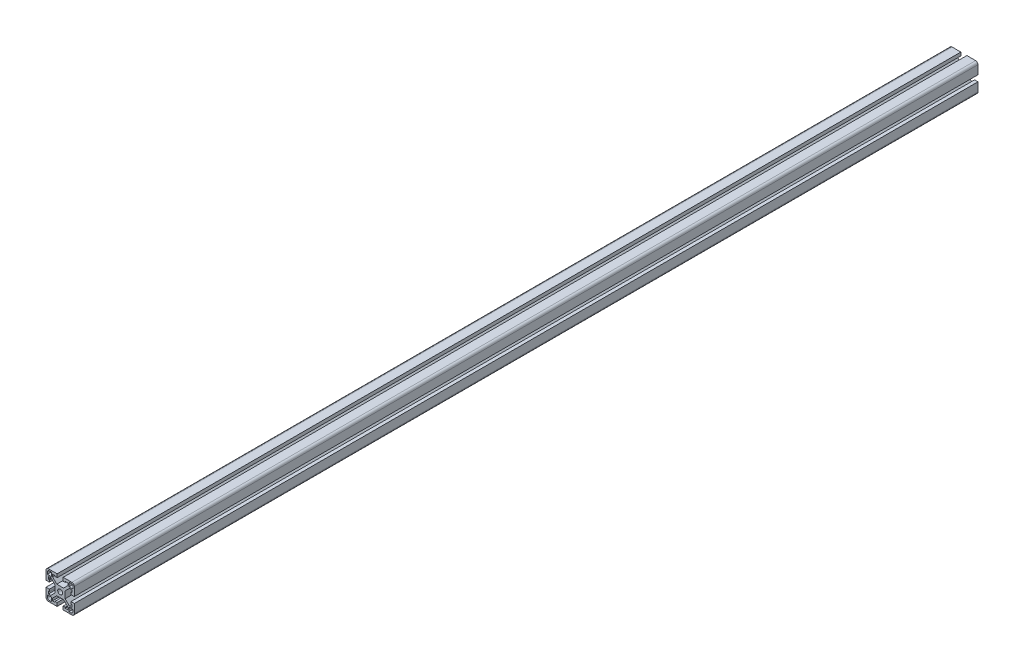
ISO-10303-21;
HEADER;
FILE_DESCRIPTION(('STEP AP214'),'2;1');
FILE_NAME('part.step','',(''),(''),'','','');
FILE_SCHEMA(('AUTOMOTIVE_DESIGN { 1 0 10303 214 1 1 1 1 }'));
ENDSEC;
DATA;
#1=APPLICATION_CONTEXT('core data for automotive mechanical design processes');
#2=APPLICATION_PROTOCOL_DEFINITION('international standard','automotive_design',2000,#1);
#3=PRODUCT_CONTEXT('',#1,'mechanical');
#4=PRODUCT('Part','Part','',(#3));
#5=PRODUCT_RELATED_PRODUCT_CATEGORY('part','',(#4));
#6=PRODUCT_DEFINITION_FORMATION('','',#4);
#7=PRODUCT_DEFINITION_CONTEXT('part definition',#1,'design');
#8=PRODUCT_DEFINITION('design','',#6,#7);
#9=PRODUCT_DEFINITION_SHAPE('','',#8);
#10=(LENGTH_UNIT() NAMED_UNIT(*) SI_UNIT(.MILLI.,.METRE.));
#11=(NAMED_UNIT(*) PLANE_ANGLE_UNIT() SI_UNIT($,.RADIAN.));
#12=(NAMED_UNIT(*) SI_UNIT($,.STERADIAN.) SOLID_ANGLE_UNIT());
#13=UNCERTAINTY_MEASURE_WITH_UNIT(LENGTH_MEASURE(1.E-05),#10,'distance_accuracy_value','');
#14=(GEOMETRIC_REPRESENTATION_CONTEXT(3) GLOBAL_UNCERTAINTY_ASSIGNED_CONTEXT((#13)) GLOBAL_UNIT_ASSIGNED_CONTEXT((#10,
#11,#12)) REPRESENTATION_CONTEXT('',''));
#15=CARTESIAN_POINT('',(0.,0.,0.));
#16=DIRECTION('',(0.,0.,1.));
#17=DIRECTION('',(1.,0.,0.));
#18=AXIS2_PLACEMENT_3D('',#15,#16,#17);
#19=CARTESIAN_POINT('',(-12.4422614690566,10.287,-1271.68453672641));
#20=DIRECTION('',(-0.707106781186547,-0.707106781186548,0.));
#21=DIRECTION('',(0.707106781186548,-0.707106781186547,0.));
#22=AXIS2_PLACEMENT_3D('',#19,#20,#21);
#23=PLANE('',#22);
#24=DIRECTION('',(0.,0.,1.));
#25=VECTOR('',#24,1.);
#26=CARTESIAN_POINT('',(-12.4422614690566,10.287,-1271.68453672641));
#27=LINE('',#26,#25);
#28=CARTESIAN_POINT('',(-12.4422614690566,10.287,-1217.803));
#29=VERTEX_POINT('',#28);
#30=CARTESIAN_POINT('',(-12.4422614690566,10.287,0.));
#31=VERTEX_POINT('',#30);
#32=EDGE_CURVE('E575',#29,#31,#27,.T.);
#33=ORIENTED_EDGE('',*,*,#32,.F.);
#34=DIRECTION('',(0.707106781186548,-0.707106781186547,0.));
#35=VECTOR('',#34,1.);
#36=CARTESIAN_POINT('',(-12.4422614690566,10.287,-1217.803));
#37=LINE('',#36,#35);
#38=CARTESIAN_POINT('',(-6.731,4.57573853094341,-1217.803));
#39=VERTEX_POINT('',#38);
#40=EDGE_CURVE('E757',#29,#39,#37,.T.);
#41=ORIENTED_EDGE('',*,*,#40,.T.);
#42=DIRECTION('',(0.,0.,1.));
#43=VECTOR('',#42,1.);
#44=CARTESIAN_POINT('',(-6.731,4.57573853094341,-1271.68453672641));
#45=LINE('',#44,#43);
#46=CARTESIAN_POINT('',(-6.731,4.57573853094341,0.));
#47=VERTEX_POINT('',#46);
#48=EDGE_CURVE('E755',#39,#47,#45,.T.);
#49=ORIENTED_EDGE('',*,*,#48,.T.);
#50=DIRECTION('',(0.707106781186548,-0.707106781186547,0.));
#51=VECTOR('',#50,1.);
#52=CARTESIAN_POINT('',(-12.4422614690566,10.287,0.));
#53=LINE('',#52,#51);
#54=EDGE_CURVE('E828',#31,#47,#53,.T.);
#55=ORIENTED_EDGE('',*,*,#54,.F.);
#56=EDGE_LOOP('',(#33,#41,#49,#55));
#57=FACE_BOUND('',#56,.T.);
#58=ADVANCED_FACE('F33',(#57),#23,.T.);
#59=CARTESIAN_POINT('',(-15.6718,10.2870000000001,-1271.68453672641));
#60=DIRECTION('',(0.,-1.,0.));
#61=DIRECTION('',(1.,0.,0.));
#62=AXIS2_PLACEMENT_3D('',#59,#60,#61);
#63=PLANE('',#62);
#64=DIRECTION('',(0.,0.,1.));
#65=VECTOR('',#64,1.);
#66=CARTESIAN_POINT('',(-15.6718,10.2870000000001,-1271.68453672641));
#67=LINE('',#66,#65);
#68=CARTESIAN_POINT('',(-15.6718,10.2870000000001,-1217.803));
#69=VERTEX_POINT('',#68);
#70=CARTESIAN_POINT('',(-15.6718,10.2870000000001,0.));
#71=VERTEX_POINT('',#70);
#72=EDGE_CURVE('E579',#69,#71,#67,.T.);
#73=ORIENTED_EDGE('',*,*,#72,.F.);
#74=DIRECTION('',(1.,0.,0.));
#75=VECTOR('',#74,1.);
#76=CARTESIAN_POINT('',(-15.6718,10.2870000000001,-1217.803));
#77=LINE('',#76,#75);
#78=EDGE_CURVE('E578',#69,#29,#77,.T.);
#79=ORIENTED_EDGE('',*,*,#78,.T.);
#80=ORIENTED_EDGE('',*,*,#32,.T.);
#81=DIRECTION('',(1.,0.,0.));
#82=VECTOR('',#81,1.);
#83=CARTESIAN_POINT('',(-15.6718,10.2870000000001,0.));
#84=LINE('',#83,#82);
#85=EDGE_CURVE('E837',#71,#31,#84,.T.);
#86=ORIENTED_EDGE('',*,*,#85,.F.);
#87=EDGE_LOOP('',(#73,#79,#80,#86));
#88=FACE_BOUND('',#87,.T.);
#89=ADVANCED_FACE('F1067',(#88),#63,.T.);
#90=CARTESIAN_POINT('',(-15.6718,6.85800000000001,-1271.68453672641));
#91=DIRECTION('',(1.,0.,0.));
#92=DIRECTION('',(0.,0.,-1.));
#93=AXIS2_PLACEMENT_3D('',#90,#91,#92);
#94=PLANE('',#93);
#95=DIRECTION('',(0.,0.,1.));
#96=VECTOR('',#95,1.);
#97=CARTESIAN_POINT('',(-15.6718,6.85800000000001,-1271.68453672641));
#98=LINE('',#97,#96);
#99=CARTESIAN_POINT('',(-15.6718,6.85800000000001,-1217.803));
#100=VERTEX_POINT('',#99);
#101=CARTESIAN_POINT('',(-15.6718,6.85800000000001,0.));
#102=VERTEX_POINT('',#101);
#103=EDGE_CURVE('E582',#100,#102,#98,.T.);
#104=ORIENTED_EDGE('',*,*,#103,.F.);
#105=DIRECTION('',(0.,1.,0.));
#106=VECTOR('',#105,1.);
#107=CARTESIAN_POINT('',(-15.6718,6.85799999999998,-1217.803));
#108=LINE('',#107,#106);
#109=EDGE_CURVE('E577',#100,#69,#108,.T.);
#110=ORIENTED_EDGE('',*,*,#109,.T.);
#111=ORIENTED_EDGE('',*,*,#72,.T.);
#112=DIRECTION('',(0.,1.,0.));
#113=VECTOR('',#112,1.);
#114=CARTESIAN_POINT('',(-15.6718,6.85800000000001,0.));
#115=LINE('',#114,#113);
#116=EDGE_CURVE('E1453',#102,#71,#115,.T.);
#117=ORIENTED_EDGE('',*,*,#116,.F.);
#118=EDGE_LOOP('',(#104,#110,#111,#117));
#119=FACE_BOUND('',#118,.T.);
#120=ADVANCED_FACE('F1073',(#119),#94,.T.);
#121=CARTESIAN_POINT('',(-14.478,6.85800000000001,-1271.68453672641));
#122=DIRECTION('',(0.,1.,0.));
#123=DIRECTION('',(0.,0.,1.));
#124=AXIS2_PLACEMENT_3D('',#121,#122,#123);
#125=PLANE('',#124);
#126=DIRECTION('',(0.,0.,1.));
#127=VECTOR('',#126,1.);
#128=CARTESIAN_POINT('',(-14.478,6.85800000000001,-1271.68453672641));
#129=LINE('',#128,#127);
#130=CARTESIAN_POINT('',(-14.478,6.85800000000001,-1217.803));
#131=VERTEX_POINT('',#130);
#132=CARTESIAN_POINT('',(-14.478,6.85800000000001,0.));
#133=VERTEX_POINT('',#132);
#134=EDGE_CURVE('E585',#131,#133,#129,.T.);
#135=ORIENTED_EDGE('',*,*,#134,.F.);
#136=DIRECTION('',(-1.,0.,0.));
#137=VECTOR('',#136,1.);
#138=CARTESIAN_POINT('',(-14.478,6.85800000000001,-1217.803));
#139=LINE('',#138,#137);
#140=EDGE_CURVE('E581',#131,#100,#139,.T.);
#141=ORIENTED_EDGE('',*,*,#140,.T.);
#142=ORIENTED_EDGE('',*,*,#103,.T.);
#143=DIRECTION('',(-1.,0.,0.));
#144=VECTOR('',#143,1.);
#145=CARTESIAN_POINT('',(-14.478,6.85800000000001,0.));
#146=LINE('',#145,#144);
#147=EDGE_CURVE('E1462',#133,#102,#146,.T.);
#148=ORIENTED_EDGE('',*,*,#147,.F.);
#149=EDGE_LOOP('',(#135,#141,#142,#148));
#150=FACE_BOUND('',#149,.T.);
#151=ADVANCED_FACE('F1442',(#150),#125,.T.);
#152=CARTESIAN_POINT('',(-14.478,4.06400000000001,-1271.68453672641));
#153=DIRECTION('',(1.,0.,0.));
#154=DIRECTION('',(0.,0.,-1.));
#155=AXIS2_PLACEMENT_3D('',#152,#153,#154);
#156=PLANE('',#155);
#157=DIRECTION('',(0.,0.,1.));
#158=VECTOR('',#157,1.);
#159=CARTESIAN_POINT('',(-14.478,4.06400000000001,-1271.68453672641));
#160=LINE('',#159,#158);
#161=CARTESIAN_POINT('',(-14.478,4.06400000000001,-1217.803));
#162=VERTEX_POINT('',#161);
#163=CARTESIAN_POINT('',(-14.478,4.06400000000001,0.));
#164=VERTEX_POINT('',#163);
#165=EDGE_CURVE('E588',#162,#164,#160,.T.);
#166=ORIENTED_EDGE('',*,*,#165,.F.);
#167=DIRECTION('',(0.,1.,0.));
#168=VECTOR('',#167,1.);
#169=CARTESIAN_POINT('',(-14.478,4.06399999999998,-1217.803));
#170=LINE('',#169,#168);
#171=EDGE_CURVE('E584',#162,#131,#170,.T.);
#172=ORIENTED_EDGE('',*,*,#171,.T.);
#173=ORIENTED_EDGE('',*,*,#134,.T.);
#174=DIRECTION('',(0.,1.,0.));
#175=VECTOR('',#174,1.);
#176=CARTESIAN_POINT('',(-14.478,4.06400000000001,0.));
#177=LINE('',#176,#175);
#178=EDGE_CURVE('E1465',#164,#133,#177,.T.);
#179=ORIENTED_EDGE('',*,*,#178,.F.);
#180=EDGE_LOOP('',(#166,#172,#173,#179));
#181=FACE_BOUND('',#180,.T.);
#182=ADVANCED_FACE('F1438',(#181),#156,.T.);
#183=CARTESIAN_POINT('',(-19.05,4.06400000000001,-1271.68453672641));
#184=DIRECTION('',(0.,-1.,0.));
#185=DIRECTION('',(1.,0.,0.));
#186=AXIS2_PLACEMENT_3D('',#183,#184,#185);
#187=PLANE('',#186);
#188=DIRECTION('',(0.,0.,1.));
#189=VECTOR('',#188,1.);
#190=CARTESIAN_POINT('',(-19.05,4.06400000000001,-1271.68453672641));
#191=LINE('',#190,#189);
#192=CARTESIAN_POINT('',(-19.05,4.06400000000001,-1217.803));
#193=VERTEX_POINT('',#192);
#194=CARTESIAN_POINT('',(-19.05,4.06400000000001,0.));
#195=VERTEX_POINT('',#194);
#196=EDGE_CURVE('E591',#193,#195,#191,.T.);
#197=ORIENTED_EDGE('',*,*,#196,.F.);
#198=DIRECTION('',(1.,0.,0.));
#199=VECTOR('',#198,1.);
#200=CARTESIAN_POINT('',(-19.05,4.06400000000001,-1217.803));
#201=LINE('',#200,#199);
#202=EDGE_CURVE('E587',#193,#162,#201,.T.);
#203=ORIENTED_EDGE('',*,*,#202,.T.);
#204=ORIENTED_EDGE('',*,*,#165,.T.);
#205=DIRECTION('',(1.,0.,0.));
#206=VECTOR('',#205,1.);
#207=CARTESIAN_POINT('',(-19.05,4.06400000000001,0.));
#208=LINE('',#207,#206);
#209=EDGE_CURVE('E1469',#195,#164,#208,.T.);
#210=ORIENTED_EDGE('',*,*,#209,.F.);
#211=EDGE_LOOP('',(#197,#203,#204,#210));
#212=FACE_BOUND('',#211,.T.);
#213=ADVANCED_FACE('F1434',(#212),#187,.T.);
#214=CARTESIAN_POINT('',(-19.05,15.875,-1271.68453672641));
#215=DIRECTION('',(-1.,0.,0.));
#216=DIRECTION('',(0.,-1.,0.));
#217=AXIS2_PLACEMENT_3D('',#214,#215,#216);
#218=PLANE('',#217);
#219=DIRECTION('',(0.,0.,1.));
#220=VECTOR('',#219,1.);
#221=CARTESIAN_POINT('',(-19.05,15.875,-1271.68453672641));
#222=LINE('',#221,#220);
#223=CARTESIAN_POINT('',(-19.05,15.875,-1217.803));
#224=VERTEX_POINT('',#223);
#225=CARTESIAN_POINT('',(-19.05,15.875,0.));
#226=VERTEX_POINT('',#225);
#227=EDGE_CURVE('E594',#224,#226,#222,.T.);
#228=ORIENTED_EDGE('',*,*,#227,.F.);
#229=DIRECTION('',(0.,-1.,0.));
#230=VECTOR('',#229,1.);
#231=CARTESIAN_POINT('',(-19.05,15.875,-1217.803));
#232=LINE('',#231,#230);
#233=EDGE_CURVE('E590',#224,#193,#232,.T.);
#234=ORIENTED_EDGE('',*,*,#233,.T.);
#235=ORIENTED_EDGE('',*,*,#196,.T.);
#236=DIRECTION('',(0.,-1.,0.));
#237=VECTOR('',#236,1.);
#238=CARTESIAN_POINT('',(-19.05,15.875,0.));
#239=LINE('',#238,#237);
#240=EDGE_CURVE('E1472',#226,#195,#239,.T.);
#241=ORIENTED_EDGE('',*,*,#240,.F.);
#242=EDGE_LOOP('',(#228,#234,#235,#241));
#243=FACE_BOUND('',#242,.T.);
#244=ADVANCED_FACE('F1430',(#243),#218,.T.);
#245=CARTESIAN_POINT('',(-15.875,15.875,-1271.68453672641));
#246=DIRECTION('',(0.,0.,1.));
#247=DIRECTION('',(1.,0.,0.));
#248=AXIS2_PLACEMENT_3D('',#245,#246,#247);
#249=CYLINDRICAL_SURFACE('',#248,3.17499999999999);
#250=DIRECTION('',(0.,0.,1.));
#251=VECTOR('',#250,1.);
#252=CARTESIAN_POINT('',(-15.875,19.05,-1271.68453672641));
#253=LINE('',#252,#251);
#254=CARTESIAN_POINT('',(-15.875,19.05,-1217.803));
#255=VERTEX_POINT('',#254);
#256=CARTESIAN_POINT('',(-15.875,19.05,0.));
#257=VERTEX_POINT('',#256);
#258=EDGE_CURVE('E597',#255,#257,#253,.T.);
#259=ORIENTED_EDGE('',*,*,#258,.F.);
#260=CARTESIAN_POINT('',(-15.875,15.875,-1217.803));
#261=DIRECTION('',(0.,0.,-1.));
#262=DIRECTION('',(0.,1.,0.));
#263=AXIS2_PLACEMENT_3D('',#260,#261,#262);
#264=CIRCLE('',#263,3.17499999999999);
#265=EDGE_CURVE('E593',#255,#224,#264,.F.);
#266=ORIENTED_EDGE('',*,*,#265,.T.);
#267=ORIENTED_EDGE('',*,*,#227,.T.);
#268=CARTESIAN_POINT('',(-15.875,15.875,0.));
#269=DIRECTION('',(0.,0.,1.));
#270=DIRECTION('',(1.,0.,0.));
#271=AXIS2_PLACEMENT_3D('',#268,#269,#270);
#272=CIRCLE('',#271,3.17499999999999);
#273=EDGE_CURVE('E1475',#257,#226,#272,.T.);
#274=ORIENTED_EDGE('',*,*,#273,.F.);
#275=EDGE_LOOP('',(#259,#266,#267,#274));
#276=FACE_BOUND('',#275,.T.);
#277=ADVANCED_FACE('F1426',(#276),#249,.T.);
#278=CARTESIAN_POINT('',(-4.06400000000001,19.05,-1271.68453672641));
#279=DIRECTION('',(0.,1.,0.));
#280=DIRECTION('',(-1.,0.,0.));
#281=AXIS2_PLACEMENT_3D('',#278,#279,#280);
#282=PLANE('',#281);
#283=DIRECTION('',(0.,0.,1.));
#284=VECTOR('',#283,1.);
#285=CARTESIAN_POINT('',(-4.06400000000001,19.05,-1271.68453672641));
#286=LINE('',#285,#284);
#287=CARTESIAN_POINT('',(-4.06400000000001,19.05,-1217.803));
#288=VERTEX_POINT('',#287);
#289=CARTESIAN_POINT('',(-4.06400000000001,19.05,0.));
#290=VERTEX_POINT('',#289);
#291=EDGE_CURVE('E600',#288,#290,#286,.T.);
#292=ORIENTED_EDGE('',*,*,#291,.F.);
#293=DIRECTION('',(-1.,0.,0.));
#294=VECTOR('',#293,1.);
#295=CARTESIAN_POINT('',(-4.06399999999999,19.05,-1217.803));
#296=LINE('',#295,#294);
#297=EDGE_CURVE('E596',#288,#255,#296,.T.);
#298=ORIENTED_EDGE('',*,*,#297,.T.);
#299=ORIENTED_EDGE('',*,*,#258,.T.);
#300=DIRECTION('',(-1.,0.,0.));
#301=VECTOR('',#300,1.);
#302=CARTESIAN_POINT('',(-4.06400000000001,19.05,0.));
#303=LINE('',#302,#301);
#304=EDGE_CURVE('E1478',#290,#257,#303,.T.);
#305=ORIENTED_EDGE('',*,*,#304,.F.);
#306=EDGE_LOOP('',(#292,#298,#299,#305));
#307=FACE_BOUND('',#306,.T.);
#308=ADVANCED_FACE('F1422',(#307),#282,.T.);
#309=CARTESIAN_POINT('',(-4.064,14.478,-1271.68453672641));
#310=DIRECTION('',(1.,0.,0.));
#311=DIRECTION('',(0.,1.,0.));
#312=AXIS2_PLACEMENT_3D('',#309,#310,#311);
#313=PLANE('',#312);
#314=DIRECTION('',(0.,0.,1.));
#315=VECTOR('',#314,1.);
#316=CARTESIAN_POINT('',(-4.064,14.478,-1271.68453672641));
#317=LINE('',#316,#315);
#318=CARTESIAN_POINT('',(-4.06400000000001,14.478,-1217.803));
#319=VERTEX_POINT('',#318);
#320=CARTESIAN_POINT('',(-4.064,14.478,0.));
#321=VERTEX_POINT('',#320);
#322=EDGE_CURVE('E603',#319,#321,#317,.T.);
#323=ORIENTED_EDGE('',*,*,#322,.F.);
#324=DIRECTION('',(0.,1.,0.));
#325=VECTOR('',#324,1.);
#326=CARTESIAN_POINT('',(-4.064,14.478,-1217.803));
#327=LINE('',#326,#325);
#328=EDGE_CURVE('E599',#319,#288,#327,.T.);
#329=ORIENTED_EDGE('',*,*,#328,.T.);
#330=ORIENTED_EDGE('',*,*,#291,.T.);
#331=DIRECTION('',(0.,1.,0.));
#332=VECTOR('',#331,1.);
#333=CARTESIAN_POINT('',(-4.064,14.478,0.));
#334=LINE('',#333,#332);
#335=EDGE_CURVE('E1481',#321,#290,#334,.T.);
#336=ORIENTED_EDGE('',*,*,#335,.F.);
#337=EDGE_LOOP('',(#323,#329,#330,#336));
#338=FACE_BOUND('',#337,.T.);
#339=ADVANCED_FACE('F1418',(#338),#313,.T.);
#340=CARTESIAN_POINT('',(-6.858,14.478,-1271.68453672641));
#341=DIRECTION('',(0.,-1.,0.));
#342=DIRECTION('',(0.,0.,-1.));
#343=AXIS2_PLACEMENT_3D('',#340,#341,#342);
#344=PLANE('',#343);
#345=DIRECTION('',(0.,0.,1.));
#346=VECTOR('',#345,1.);
#347=CARTESIAN_POINT('',(-6.858,14.478,-1271.68453672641));
#348=LINE('',#347,#346);
#349=CARTESIAN_POINT('',(-6.858,14.478,-1217.803));
#350=VERTEX_POINT('',#349);
#351=CARTESIAN_POINT('',(-6.858,14.478,0.));
#352=VERTEX_POINT('',#351);
#353=EDGE_CURVE('E606',#350,#352,#348,.T.);
#354=ORIENTED_EDGE('',*,*,#353,.F.);
#355=DIRECTION('',(1.,0.,0.));
#356=VECTOR('',#355,1.);
#357=CARTESIAN_POINT('',(-6.85799999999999,14.478,-1217.803));
#358=LINE('',#357,#356);
#359=EDGE_CURVE('E602',#350,#319,#358,.T.);
#360=ORIENTED_EDGE('',*,*,#359,.T.);
#361=ORIENTED_EDGE('',*,*,#322,.T.);
#362=DIRECTION('',(1.,0.,0.));
#363=VECTOR('',#362,1.);
#364=CARTESIAN_POINT('',(-6.858,14.478,0.));
#365=LINE('',#364,#363);
#366=EDGE_CURVE('E1484',#352,#321,#365,.T.);
#367=ORIENTED_EDGE('',*,*,#366,.F.);
#368=EDGE_LOOP('',(#354,#360,#361,#367));
#369=FACE_BOUND('',#368,.T.);
#370=ADVANCED_FACE('F1414',(#369),#344,.T.);
#371=CARTESIAN_POINT('',(-6.858,15.6718,-1271.68453672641));
#372=DIRECTION('',(-1.,0.,0.));
#373=DIRECTION('',(0.,0.,1.));
#374=AXIS2_PLACEMENT_3D('',#371,#372,#373);
#375=PLANE('',#374);
#376=DIRECTION('',(0.,0.,1.));
#377=VECTOR('',#376,1.);
#378=CARTESIAN_POINT('',(-6.858,15.6718,-1271.68453672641));
#379=LINE('',#378,#377);
#380=CARTESIAN_POINT('',(-6.858,15.6718,-1217.803));
#381=VERTEX_POINT('',#380);
#382=CARTESIAN_POINT('',(-6.858,15.6718,0.));
#383=VERTEX_POINT('',#382);
#384=EDGE_CURVE('E609',#381,#383,#379,.T.);
#385=ORIENTED_EDGE('',*,*,#384,.F.);
#386=DIRECTION('',(0.,-1.,0.));
#387=VECTOR('',#386,1.);
#388=CARTESIAN_POINT('',(-6.858,15.6717999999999,-1217.803));
#389=LINE('',#388,#387);
#390=EDGE_CURVE('E605',#381,#350,#389,.T.);
#391=ORIENTED_EDGE('',*,*,#390,.T.);
#392=ORIENTED_EDGE('',*,*,#353,.T.);
#393=DIRECTION('',(0.,-1.,0.));
#394=VECTOR('',#393,1.);
#395=CARTESIAN_POINT('',(-6.858,15.6718,0.));
#396=LINE('',#395,#394);
#397=EDGE_CURVE('E1487',#383,#352,#396,.T.);
#398=ORIENTED_EDGE('',*,*,#397,.F.);
#399=EDGE_LOOP('',(#385,#391,#392,#398));
#400=FACE_BOUND('',#399,.T.);
#401=ADVANCED_FACE('F1410',(#400),#375,.T.);
#402=CARTESIAN_POINT('',(-10.287,15.6718,-1271.68453672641));
#403=DIRECTION('',(0.,-1.,0.));
#404=DIRECTION('',(0.,0.,-1.));
#405=AXIS2_PLACEMENT_3D('',#402,#403,#404);
#406=PLANE('',#405);
#407=DIRECTION('',(0.,0.,1.));
#408=VECTOR('',#407,1.);
#409=CARTESIAN_POINT('',(-10.287,15.6718,-1271.68453672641));
#410=LINE('',#409,#408);
#411=CARTESIAN_POINT('',(-10.287,15.6718,-1217.803));
#412=VERTEX_POINT('',#411);
#413=CARTESIAN_POINT('',(-10.287,15.6718,0.));
#414=VERTEX_POINT('',#413);
#415=EDGE_CURVE('E612',#412,#414,#410,.T.);
#416=ORIENTED_EDGE('',*,*,#415,.F.);
#417=DIRECTION('',(1.,0.,0.));
#418=VECTOR('',#417,1.);
#419=CARTESIAN_POINT('',(-10.287,15.6718,-1217.803));
#420=LINE('',#419,#418);
#421=EDGE_CURVE('E608',#412,#381,#420,.T.);
#422=ORIENTED_EDGE('',*,*,#421,.T.);
#423=ORIENTED_EDGE('',*,*,#384,.T.);
#424=DIRECTION('',(1.,0.,0.));
#425=VECTOR('',#424,1.);
#426=CARTESIAN_POINT('',(-10.287,15.6718,0.));
#427=LINE('',#426,#425);
#428=EDGE_CURVE('E1490',#414,#383,#427,.T.);
#429=ORIENTED_EDGE('',*,*,#428,.F.);
#430=EDGE_LOOP('',(#416,#422,#423,#429));
#431=FACE_BOUND('',#430,.T.);
#432=ADVANCED_FACE('F1406',(#431),#406,.T.);
#433=CARTESIAN_POINT('',(-10.287,12.4422614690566,-1271.68453672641));
#434=DIRECTION('',(1.,0.,0.));
#435=DIRECTION('',(0.,1.,0.));
#436=AXIS2_PLACEMENT_3D('',#433,#434,#435);
#437=PLANE('',#436);
#438=DIRECTION('',(0.,0.,1.));
#439=VECTOR('',#438,1.);
#440=CARTESIAN_POINT('',(-10.287,12.4422614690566,-1271.68453672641));
#441=LINE('',#440,#439);
#442=CARTESIAN_POINT('',(-10.287,12.4422614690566,-1217.803));
#443=VERTEX_POINT('',#442);
#444=CARTESIAN_POINT('',(-10.287,12.4422614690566,0.));
#445=VERTEX_POINT('',#444);
#446=EDGE_CURVE('E615',#443,#445,#441,.T.);
#447=ORIENTED_EDGE('',*,*,#446,.F.);
#448=DIRECTION('',(0.,1.,0.));
#449=VECTOR('',#448,1.);
#450=CARTESIAN_POINT('',(-10.287,12.4422614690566,-1217.803));
#451=LINE('',#450,#449);
#452=EDGE_CURVE('E611',#443,#412,#451,.T.);
#453=ORIENTED_EDGE('',*,*,#452,.T.);
#454=ORIENTED_EDGE('',*,*,#415,.T.);
#455=DIRECTION('',(0.,1.,0.));
#456=VECTOR('',#455,1.);
#457=CARTESIAN_POINT('',(-10.287,12.4422614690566,0.));
#458=LINE('',#457,#456);
#459=EDGE_CURVE('E1493',#445,#414,#458,.T.);
#460=ORIENTED_EDGE('',*,*,#459,.F.);
#461=EDGE_LOOP('',(#447,#453,#454,#460));
#462=FACE_BOUND('',#461,.T.);
#463=ADVANCED_FACE('F1402',(#462),#437,.T.);
#464=CARTESIAN_POINT('',(-4.57573853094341,6.73100000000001,-1271.68453672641));
#465=DIRECTION('',(0.707106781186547,0.707106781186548,0.));
#466=DIRECTION('',(-0.707106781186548,0.707106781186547,0.));
#467=AXIS2_PLACEMENT_3D('',#464,#465,#466);
#468=PLANE('',#467);
#469=DIRECTION('',(0.,0.,1.));
#470=VECTOR('',#469,1.);
#471=CARTESIAN_POINT('',(-4.57573853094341,6.73100000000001,-1271.68453672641));
#472=LINE('',#471,#470);
#473=CARTESIAN_POINT('',(-4.57573853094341,6.73100000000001,-1217.803));
#474=VERTEX_POINT('',#473);
#475=CARTESIAN_POINT('',(-4.57573853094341,6.73100000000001,0.));
#476=VERTEX_POINT('',#475);
#477=EDGE_CURVE('E618',#474,#476,#472,.T.);
#478=ORIENTED_EDGE('',*,*,#477,.F.);
#479=DIRECTION('',(-0.707106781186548,0.707106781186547,0.));
#480=VECTOR('',#479,1.);
#481=CARTESIAN_POINT('',(-4.57573853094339,6.73099999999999,-1217.803));
#482=LINE('',#481,#480);
#483=EDGE_CURVE('E614',#474,#443,#482,.T.);
#484=ORIENTED_EDGE('',*,*,#483,.T.);
#485=ORIENTED_EDGE('',*,*,#446,.T.);
#486=DIRECTION('',(-0.707106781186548,0.707106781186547,0.));
#487=VECTOR('',#486,1.);
#488=CARTESIAN_POINT('',(-4.57573853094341,6.73100000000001,0.));
#489=LINE('',#488,#487);
#490=EDGE_CURVE('E1496',#476,#445,#489,.T.);
#491=ORIENTED_EDGE('',*,*,#490,.F.);
#492=EDGE_LOOP('',(#478,#484,#485,#491));
#493=FACE_BOUND('',#492,.T.);
#494=ADVANCED_FACE('F1398',(#493),#468,.T.);
#495=CARTESIAN_POINT('',(4.57573853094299,6.73100000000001,-1271.68453672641));
#496=DIRECTION('',(0.,1.,0.));
#497=DIRECTION('',(0.,0.,1.));
#498=AXIS2_PLACEMENT_3D('',#495,#496,#497);
#499=PLANE('',#498);
#500=DIRECTION('',(0.,0.,1.));
#501=VECTOR('',#500,1.);
#502=CARTESIAN_POINT('',(4.57573853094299,6.73100000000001,-1271.68453672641));
#503=LINE('',#502,#501);
#504=CARTESIAN_POINT('',(4.57573853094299,6.73100000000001,-1217.803));
#505=VERTEX_POINT('',#504);
#506=CARTESIAN_POINT('',(4.57573853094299,6.73100000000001,0.));
#507=VERTEX_POINT('',#506);
#508=EDGE_CURVE('E621',#505,#507,#503,.T.);
#509=ORIENTED_EDGE('',*,*,#508,.F.);
#510=DIRECTION('',(-1.,0.,0.));
#511=VECTOR('',#510,1.);
#512=CARTESIAN_POINT('',(4.57573853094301,6.73100000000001,-1217.803));
#513=LINE('',#512,#511);
#514=EDGE_CURVE('E617',#505,#474,#513,.T.);
#515=ORIENTED_EDGE('',*,*,#514,.T.);
#516=ORIENTED_EDGE('',*,*,#477,.T.);
#517=DIRECTION('',(-1.,0.,0.));
#518=VECTOR('',#517,1.);
#519=CARTESIAN_POINT('',(4.57573853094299,6.73100000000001,0.));
#520=LINE('',#519,#518);
#521=EDGE_CURVE('E1499',#507,#476,#520,.T.);
#522=ORIENTED_EDGE('',*,*,#521,.F.);
#523=EDGE_LOOP('',(#509,#515,#516,#522));
#524=FACE_BOUND('',#523,.T.);
#525=ADVANCED_FACE('F1394',(#524),#499,.T.);
#526=CARTESIAN_POINT('',(10.2869999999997,12.4422614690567,-1271.68453672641));
#527=DIRECTION('',(-0.707106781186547,0.707106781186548,0.));
#528=DIRECTION('',(-0.707106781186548,-0.707106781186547,0.));
#529=AXIS2_PLACEMENT_3D('',#526,#527,#528);
#530=PLANE('',#529);
#531=DIRECTION('',(0.,0.,1.));
#532=VECTOR('',#531,1.);
#533=CARTESIAN_POINT('',(10.2869999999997,12.4422614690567,-1271.68453672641));
#534=LINE('',#533,#532);
#535=CARTESIAN_POINT('',(10.2869999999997,12.4422614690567,-1217.803));
#536=VERTEX_POINT('',#535);
#537=CARTESIAN_POINT('',(10.2869999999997,12.4422614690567,0.));
#538=VERTEX_POINT('',#537);
#539=EDGE_CURVE('E624',#536,#538,#534,.T.);
#540=ORIENTED_EDGE('',*,*,#539,.F.);
#541=DIRECTION('',(-0.707106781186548,-0.707106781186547,0.));
#542=VECTOR('',#541,1.);
#543=CARTESIAN_POINT('',(10.2869999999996,12.4422614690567,-1217.803));
#544=LINE('',#543,#542);
#545=EDGE_CURVE('E620',#536,#505,#544,.T.);
#546=ORIENTED_EDGE('',*,*,#545,.T.);
#547=ORIENTED_EDGE('',*,*,#508,.T.);
#548=DIRECTION('',(-0.707106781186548,-0.707106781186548,0.));
#549=VECTOR('',#548,1.);
#550=CARTESIAN_POINT('',(10.2869999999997,12.4422614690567,0.));
#551=LINE('',#550,#549);
#552=EDGE_CURVE('E1502',#538,#507,#551,.T.);
#553=ORIENTED_EDGE('',*,*,#552,.F.);
#554=EDGE_LOOP('',(#540,#546,#547,#553));
#555=FACE_BOUND('',#554,.T.);
#556=ADVANCED_FACE('F1390',(#555),#530,.T.);
#557=CARTESIAN_POINT('',(10.2869999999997,15.6718000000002,-1271.68453672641));
#558=DIRECTION('',(-1.,0.,0.));
#559=DIRECTION('',(0.,-1.,0.));
#560=AXIS2_PLACEMENT_3D('',#557,#558,#559);
#561=PLANE('',#560);
#562=DIRECTION('',(0.,0.,1.));
#563=VECTOR('',#562,1.);
#564=CARTESIAN_POINT('',(10.2869999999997,15.6718000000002,-1271.68453672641));
#565=LINE('',#564,#563);
#566=CARTESIAN_POINT('',(10.2869999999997,15.6718000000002,-1217.803));
#567=VERTEX_POINT('',#566);
#568=CARTESIAN_POINT('',(10.2869999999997,15.6718000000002,0.));
#569=VERTEX_POINT('',#568);
#570=EDGE_CURVE('E627',#567,#569,#565,.T.);
#571=ORIENTED_EDGE('',*,*,#570,.F.);
#572=DIRECTION('',(0.,-1.,0.));
#573=VECTOR('',#572,1.);
#574=CARTESIAN_POINT('',(10.2869999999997,15.6718000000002,-1217.803));
#575=LINE('',#574,#573);
#576=EDGE_CURVE('E623',#567,#536,#575,.T.);
#577=ORIENTED_EDGE('',*,*,#576,.T.);
#578=ORIENTED_EDGE('',*,*,#539,.T.);
#579=DIRECTION('',(0.,-1.,0.));
#580=VECTOR('',#579,1.);
#581=CARTESIAN_POINT('',(10.2869999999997,15.6718000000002,0.));
#582=LINE('',#581,#580);
#583=EDGE_CURVE('E1505',#569,#538,#582,.T.);
#584=ORIENTED_EDGE('',*,*,#583,.F.);
#585=EDGE_LOOP('',(#571,#577,#578,#584));
#586=FACE_BOUND('',#585,.T.);
#587=ADVANCED_FACE('F1386',(#586),#561,.T.);
#588=CARTESIAN_POINT('',(6.85799999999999,15.6718000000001,-1271.68453672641));
#589=DIRECTION('',(0.,-1.,0.));
#590=DIRECTION('',(1.,0.,0.));
#591=AXIS2_PLACEMENT_3D('',#588,#589,#590);
#592=PLANE('',#591);
#593=DIRECTION('',(0.,0.,1.));
#594=VECTOR('',#593,1.);
#595=CARTESIAN_POINT('',(6.85799999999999,15.6718000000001,-1271.68453672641));
#596=LINE('',#595,#594);
#597=CARTESIAN_POINT('',(6.85799999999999,15.6718000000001,-1217.803));
#598=VERTEX_POINT('',#597);
#599=CARTESIAN_POINT('',(6.85799999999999,15.6718000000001,0.));
#600=VERTEX_POINT('',#599);
#601=EDGE_CURVE('E630',#598,#600,#596,.T.);
#602=ORIENTED_EDGE('',*,*,#601,.F.);
#603=DIRECTION('',(1.,0.,0.));
#604=VECTOR('',#603,1.);
#605=CARTESIAN_POINT('',(6.858,15.6718000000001,-1217.803));
#606=LINE('',#605,#604);
#607=EDGE_CURVE('E626',#598,#567,#606,.T.);
#608=ORIENTED_EDGE('',*,*,#607,.T.);
#609=ORIENTED_EDGE('',*,*,#570,.T.);
#610=DIRECTION('',(1.,0.,0.));
#611=VECTOR('',#610,1.);
#612=CARTESIAN_POINT('',(6.85799999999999,15.6718000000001,0.));
#613=LINE('',#612,#611);
#614=EDGE_CURVE('E1508',#600,#569,#613,.T.);
#615=ORIENTED_EDGE('',*,*,#614,.F.);
#616=EDGE_LOOP('',(#602,#608,#609,#615));
#617=FACE_BOUND('',#616,.T.);
#618=ADVANCED_FACE('F1382',(#617),#592,.T.);
#619=CARTESIAN_POINT('',(6.85799999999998,14.478,-1271.68453672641));
#620=DIRECTION('',(1.,0.,0.));
#621=DIRECTION('',(0.,1.,0.));
#622=AXIS2_PLACEMENT_3D('',#619,#620,#621);
#623=PLANE('',#622);
#624=DIRECTION('',(0.,0.,1.));
#625=VECTOR('',#624,1.);
#626=CARTESIAN_POINT('',(6.85799999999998,14.478,-1271.68453672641));
#627=LINE('',#626,#625);
#628=CARTESIAN_POINT('',(6.85799999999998,14.478,-1217.803));
#629=VERTEX_POINT('',#628);
#630=CARTESIAN_POINT('',(6.85799999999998,14.478,0.));
#631=VERTEX_POINT('',#630);
#632=EDGE_CURVE('E633',#629,#631,#627,.T.);
#633=ORIENTED_EDGE('',*,*,#632,.F.);
#634=DIRECTION('',(0.,1.,0.));
#635=VECTOR('',#634,1.);
#636=CARTESIAN_POINT('',(6.85799999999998,14.478,-1217.803));
#637=LINE('',#636,#635);
#638=EDGE_CURVE('E629',#629,#598,#637,.T.);
#639=ORIENTED_EDGE('',*,*,#638,.T.);
#640=ORIENTED_EDGE('',*,*,#601,.T.);
#641=DIRECTION('',(0.,1.,0.));
#642=VECTOR('',#641,1.);
#643=CARTESIAN_POINT('',(6.85799999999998,14.478,0.));
#644=LINE('',#643,#642);
#645=EDGE_CURVE('E1511',#631,#600,#644,.T.);
#646=ORIENTED_EDGE('',*,*,#645,.F.);
#647=EDGE_LOOP('',(#633,#639,#640,#646));
#648=FACE_BOUND('',#647,.T.);
#649=ADVANCED_FACE('F1378',(#648),#623,.T.);
#650=CARTESIAN_POINT('',(4.06399999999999,14.478,-1271.68453672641));
#651=DIRECTION('',(0.,-1.,0.));
#652=DIRECTION('',(1.,0.,0.));
#653=AXIS2_PLACEMENT_3D('',#650,#651,#652);
#654=PLANE('',#653);
#655=DIRECTION('',(0.,0.,1.));
#656=VECTOR('',#655,1.);
#657=CARTESIAN_POINT('',(4.06399999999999,14.478,-1271.68453672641));
#658=LINE('',#657,#656);
#659=CARTESIAN_POINT('',(4.06399999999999,14.478,-1217.803));
#660=VERTEX_POINT('',#659);
#661=CARTESIAN_POINT('',(4.06399999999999,14.478,0.));
#662=VERTEX_POINT('',#661);
#663=EDGE_CURVE('E636',#660,#662,#658,.T.);
#664=ORIENTED_EDGE('',*,*,#663,.F.);
#665=DIRECTION('',(1.,0.,0.));
#666=VECTOR('',#665,1.);
#667=CARTESIAN_POINT('',(4.06400000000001,14.478,-1217.803));
#668=LINE('',#667,#666);
#669=EDGE_CURVE('E632',#660,#629,#668,.T.);
#670=ORIENTED_EDGE('',*,*,#669,.T.);
#671=ORIENTED_EDGE('',*,*,#632,.T.);
#672=DIRECTION('',(1.,0.,0.));
#673=VECTOR('',#672,1.);
#674=CARTESIAN_POINT('',(4.06399999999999,14.478,0.));
#675=LINE('',#674,#673);
#676=EDGE_CURVE('E1514',#662,#631,#675,.T.);
#677=ORIENTED_EDGE('',*,*,#676,.F.);
#678=EDGE_LOOP('',(#664,#670,#671,#677));
#679=FACE_BOUND('',#678,.T.);
#680=ADVANCED_FACE('F1374',(#679),#654,.T.);
#681=CARTESIAN_POINT('',(4.06399999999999,19.05,-1271.68453672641));
#682=DIRECTION('',(-1.,0.,0.));
#683=DIRECTION('',(0.,0.,1.));
#684=AXIS2_PLACEMENT_3D('',#681,#682,#683);
#685=PLANE('',#684);
#686=DIRECTION('',(0.,0.,1.));
#687=VECTOR('',#686,1.);
#688=CARTESIAN_POINT('',(4.06399999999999,19.05,-1271.68453672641));
#689=LINE('',#688,#687);
#690=CARTESIAN_POINT('',(4.06399999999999,19.05,-1217.803));
#691=VERTEX_POINT('',#690);
#692=CARTESIAN_POINT('',(4.06399999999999,19.05,0.));
#693=VERTEX_POINT('',#692);
#694=EDGE_CURVE('E639',#691,#693,#689,.T.);
#695=ORIENTED_EDGE('',*,*,#694,.F.);
#696=DIRECTION('',(0.,-1.,0.));
#697=VECTOR('',#696,1.);
#698=CARTESIAN_POINT('',(4.06399999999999,19.05,-1217.803));
#699=LINE('',#698,#697);
#700=EDGE_CURVE('E635',#691,#660,#699,.T.);
#701=ORIENTED_EDGE('',*,*,#700,.T.);
#702=ORIENTED_EDGE('',*,*,#663,.T.);
#703=DIRECTION('',(0.,-1.,0.));
#704=VECTOR('',#703,1.);
#705=CARTESIAN_POINT('',(4.06399999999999,19.05,0.));
#706=LINE('',#705,#704);
#707=EDGE_CURVE('E1517',#693,#662,#706,.T.);
#708=ORIENTED_EDGE('',*,*,#707,.F.);
#709=EDGE_LOOP('',(#695,#701,#702,#708));
#710=FACE_BOUND('',#709,.T.);
#711=ADVANCED_FACE('F1370',(#710),#685,.T.);
#712=CARTESIAN_POINT('',(15.875,19.05,-1271.68453672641));
#713=DIRECTION('',(0.,1.,0.));
#714=DIRECTION('',(-1.,0.,0.));
#715=AXIS2_PLACEMENT_3D('',#712,#713,#714);
#716=PLANE('',#715);
#717=DIRECTION('',(0.,0.,1.));
#718=VECTOR('',#717,1.);
#719=CARTESIAN_POINT('',(15.875,19.05,-1271.68453672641));
#720=LINE('',#719,#718);
#721=CARTESIAN_POINT('',(15.8750000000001,19.05,-1217.803));
#722=VERTEX_POINT('',#721);
#723=CARTESIAN_POINT('',(15.875,19.05,0.));
#724=VERTEX_POINT('',#723);
#725=EDGE_CURVE('E642',#722,#724,#720,.T.);
#726=ORIENTED_EDGE('',*,*,#725,.F.);
#727=DIRECTION('',(-1.,0.,0.));
#728=VECTOR('',#727,1.);
#729=CARTESIAN_POINT('',(15.875,19.05,-1217.803));
#730=LINE('',#729,#728);
#731=EDGE_CURVE('E638',#722,#691,#730,.T.);
#732=ORIENTED_EDGE('',*,*,#731,.T.);
#733=ORIENTED_EDGE('',*,*,#694,.T.);
#734=DIRECTION('',(-1.,0.,0.));
#735=VECTOR('',#734,1.);
#736=CARTESIAN_POINT('',(15.875,19.05,0.));
#737=LINE('',#736,#735);
#738=EDGE_CURVE('E1520',#724,#693,#737,.T.);
#739=ORIENTED_EDGE('',*,*,#738,.F.);
#740=EDGE_LOOP('',(#726,#732,#733,#739));
#741=FACE_BOUND('',#740,.T.);
#742=ADVANCED_FACE('F1366',(#741),#716,.T.);
#743=CARTESIAN_POINT('',(15.8750000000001,15.8750000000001,-1271.68453672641));
#744=DIRECTION('',(0.,0.,1.));
#745=DIRECTION('',(1.,0.,0.));
#746=AXIS2_PLACEMENT_3D('',#743,#744,#745);
#747=CYLINDRICAL_SURFACE('',#746,3.17499999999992);
#748=DIRECTION('',(0.,0.,1.));
#749=VECTOR('',#748,1.);
#750=CARTESIAN_POINT('',(19.05,15.8750000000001,-1271.68453672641));
#751=LINE('',#750,#749);
#752=CARTESIAN_POINT('',(19.05,15.8750000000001,-1217.803));
#753=VERTEX_POINT('',#752);
#754=CARTESIAN_POINT('',(19.05,15.8750000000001,0.));
#755=VERTEX_POINT('',#754);
#756=EDGE_CURVE('E645',#753,#755,#751,.T.);
#757=ORIENTED_EDGE('',*,*,#756,.F.);
#758=CARTESIAN_POINT('',(15.8750000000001,15.8750000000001,-1217.803));
#759=DIRECTION('',(0.,0.,-1.));
#760=DIRECTION('',(0.,1.,0.));
#761=AXIS2_PLACEMENT_3D('',#758,#759,#760);
#762=CIRCLE('',#761,3.17499999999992);
#763=EDGE_CURVE('E641',#753,#722,#762,.F.);
#764=ORIENTED_EDGE('',*,*,#763,.T.);
#765=ORIENTED_EDGE('',*,*,#725,.T.);
#766=CARTESIAN_POINT('',(15.8750000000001,15.8750000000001,0.));
#767=DIRECTION('',(0.,0.,1.));
#768=DIRECTION('',(1.,0.,0.));
#769=AXIS2_PLACEMENT_3D('',#766,#767,#768);
#770=CIRCLE('',#769,3.17499999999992);
#771=EDGE_CURVE('E1523',#755,#724,#770,.T.);
#772=ORIENTED_EDGE('',*,*,#771,.F.);
#773=EDGE_LOOP('',(#757,#764,#765,#772));
#774=FACE_BOUND('',#773,.T.);
#775=ADVANCED_FACE('F1362',(#774),#747,.T.);
#776=CARTESIAN_POINT('',(19.05,4.06399999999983,-1271.68453672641));
#777=DIRECTION('',(1.,0.,0.));
#778=DIRECTION('',(0.,1.,0.));
#779=AXIS2_PLACEMENT_3D('',#776,#777,#778);
#780=PLANE('',#779);
#781=DIRECTION('',(0.,0.,1.));
#782=VECTOR('',#781,1.);
#783=CARTESIAN_POINT('',(19.05,4.06399999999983,-1271.68453672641));
#784=LINE('',#783,#782);
#785=CARTESIAN_POINT('',(19.05,4.06399999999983,-1217.803));
#786=VERTEX_POINT('',#785);
#787=CARTESIAN_POINT('',(19.05,4.06399999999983,0.));
#788=VERTEX_POINT('',#787);
#789=EDGE_CURVE('E648',#786,#788,#784,.T.);
#790=ORIENTED_EDGE('',*,*,#789,.F.);
#791=DIRECTION('',(0.,1.,0.));
#792=VECTOR('',#791,1.);
#793=CARTESIAN_POINT('',(19.05,4.06399999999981,-1217.803));
#794=LINE('',#793,#792);
#795=EDGE_CURVE('E644',#786,#753,#794,.T.);
#796=ORIENTED_EDGE('',*,*,#795,.T.);
#797=ORIENTED_EDGE('',*,*,#756,.T.);
#798=DIRECTION('',(0.,1.,0.));
#799=VECTOR('',#798,1.);
#800=CARTESIAN_POINT('',(19.05,4.06399999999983,0.));
#801=LINE('',#800,#799);
#802=EDGE_CURVE('E1526',#788,#755,#801,.T.);
#803=ORIENTED_EDGE('',*,*,#802,.F.);
#804=EDGE_LOOP('',(#790,#796,#797,#803));
#805=FACE_BOUND('',#804,.T.);
#806=ADVANCED_FACE('F1358',(#805),#780,.T.);
#807=CARTESIAN_POINT('',(14.4780000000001,4.06399999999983,-1271.68453672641));
#808=DIRECTION('',(0.,-1.,0.));
#809=DIRECTION('',(0.,0.,-1.));
#810=AXIS2_PLACEMENT_3D('',#807,#808,#809);
#811=PLANE('',#810);
#812=DIRECTION('',(0.,0.,1.));
#813=VECTOR('',#812,1.);
#814=CARTESIAN_POINT('',(14.4780000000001,4.06399999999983,-1271.68453672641));
#815=LINE('',#814,#813);
#816=CARTESIAN_POINT('',(14.4780000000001,4.06399999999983,-1217.803));
#817=VERTEX_POINT('',#816);
#818=CARTESIAN_POINT('',(14.4780000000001,4.06399999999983,0.));
#819=VERTEX_POINT('',#818);
#820=EDGE_CURVE('E651',#817,#819,#815,.T.);
#821=ORIENTED_EDGE('',*,*,#820,.F.);
#822=DIRECTION('',(1.,0.,0.));
#823=VECTOR('',#822,1.);
#824=CARTESIAN_POINT('',(14.4780000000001,4.06399999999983,-1217.803));
#825=LINE('',#824,#823);
#826=EDGE_CURVE('E647',#817,#786,#825,.T.);
#827=ORIENTED_EDGE('',*,*,#826,.T.);
#828=ORIENTED_EDGE('',*,*,#789,.T.);
#829=DIRECTION('',(1.,0.,0.));
#830=VECTOR('',#829,1.);
#831=CARTESIAN_POINT('',(14.4780000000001,4.06399999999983,0.));
#832=LINE('',#831,#830);
#833=EDGE_CURVE('E1529',#819,#788,#832,.T.);
#834=ORIENTED_EDGE('',*,*,#833,.F.);
#835=EDGE_LOOP('',(#821,#827,#828,#834));
#836=FACE_BOUND('',#835,.T.);
#837=ADVANCED_FACE('F1354',(#836),#811,.T.);
#838=CARTESIAN_POINT('',(14.4780000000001,6.85799999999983,-1271.68453672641));
#839=DIRECTION('',(-1.,0.,0.));
#840=DIRECTION('',(0.,0.,1.));
#841=AXIS2_PLACEMENT_3D('',#838,#839,#840);
#842=PLANE('',#841);
#843=DIRECTION('',(0.,0.,1.));
#844=VECTOR('',#843,1.);
#845=CARTESIAN_POINT('',(14.4780000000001,6.85799999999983,-1271.68453672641));
#846=LINE('',#845,#844);
#847=CARTESIAN_POINT('',(14.4780000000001,6.85799999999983,-1217.803));
#848=VERTEX_POINT('',#847);
#849=CARTESIAN_POINT('',(14.4780000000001,6.85799999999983,0.));
#850=VERTEX_POINT('',#849);
#851=EDGE_CURVE('E654',#848,#850,#846,.T.);
#852=ORIENTED_EDGE('',*,*,#851,.F.);
#853=DIRECTION('',(0.,-1.,0.));
#854=VECTOR('',#853,1.);
#855=CARTESIAN_POINT('',(14.4780000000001,6.8579999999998,-1217.803));
#856=LINE('',#855,#854);
#857=EDGE_CURVE('E650',#848,#817,#856,.T.);
#858=ORIENTED_EDGE('',*,*,#857,.T.);
#859=ORIENTED_EDGE('',*,*,#820,.T.);
#860=DIRECTION('',(0.,-1.,0.));
#861=VECTOR('',#860,1.);
#862=CARTESIAN_POINT('',(14.4780000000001,6.85799999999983,0.));
#863=LINE('',#862,#861);
#864=EDGE_CURVE('E1532',#850,#819,#863,.T.);
#865=ORIENTED_EDGE('',*,*,#864,.F.);
#866=EDGE_LOOP('',(#852,#858,#859,#865));
#867=FACE_BOUND('',#866,.T.);
#868=ADVANCED_FACE('F1350',(#867),#842,.T.);
#869=CARTESIAN_POINT('',(15.6718,6.858,-1271.68453672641));
#870=DIRECTION('',(-1.48217284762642E-13,1.,0.));
#871=DIRECTION('',(-1.,-1.48217284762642E-13,0.));
#872=AXIS2_PLACEMENT_3D('',#869,#870,#871);
#873=PLANE('',#872);
#874=DIRECTION('',(0.,0.,1.));
#875=VECTOR('',#874,1.);
#876=CARTESIAN_POINT('',(15.6718,6.858,-1271.68453672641));
#877=LINE('',#876,#875);
#878=CARTESIAN_POINT('',(15.6718,6.858,-1217.803));
#879=VERTEX_POINT('',#878);
#880=CARTESIAN_POINT('',(15.6718,6.858,0.));
#881=VERTEX_POINT('',#880);
#882=EDGE_CURVE('E657',#879,#881,#877,.T.);
#883=ORIENTED_EDGE('',*,*,#882,.F.);
#884=DIRECTION('',(-1.,-1.48217284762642E-13,0.));
#885=VECTOR('',#884,1.);
#886=CARTESIAN_POINT('',(15.6718,6.858,-1217.803));
#887=LINE('',#886,#885);
#888=EDGE_CURVE('E653',#879,#848,#887,.T.);
#889=ORIENTED_EDGE('',*,*,#888,.T.);
#890=ORIENTED_EDGE('',*,*,#851,.T.);
#891=DIRECTION('',(-1.,-1.48217284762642E-13,0.));
#892=VECTOR('',#891,1.);
#893=CARTESIAN_POINT('',(15.6718,6.858,0.));
#894=LINE('',#893,#892);
#895=EDGE_CURVE('E1535',#881,#850,#894,.T.);
#896=ORIENTED_EDGE('',*,*,#895,.F.);
#897=EDGE_LOOP('',(#883,#889,#890,#896));
#898=FACE_BOUND('',#897,.T.);
#899=ADVANCED_FACE('F1346',(#898),#873,.T.);
#900=CARTESIAN_POINT('',(15.6718,10.2870000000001,-1271.68453672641));
#901=DIRECTION('',(-1.,0.,0.));
#902=DIRECTION('',(0.,0.,1.));
#903=AXIS2_PLACEMENT_3D('',#900,#901,#902);
#904=PLANE('',#903);
#905=DIRECTION('',(0.,0.,1.));
#906=VECTOR('',#905,1.);
#907=CARTESIAN_POINT('',(15.6718,10.2870000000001,-1271.68453672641));
#908=LINE('',#907,#906);
#909=CARTESIAN_POINT('',(15.6718,10.2870000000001,-1217.803));
#910=VERTEX_POINT('',#909);
#911=CARTESIAN_POINT('',(15.6718,10.2870000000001,0.));
#912=VERTEX_POINT('',#911);
#913=EDGE_CURVE('E660',#910,#912,#908,.T.);
#914=ORIENTED_EDGE('',*,*,#913,.F.);
#915=DIRECTION('',(0.,-1.,0.));
#916=VECTOR('',#915,1.);
#917=CARTESIAN_POINT('',(15.6718,10.287,-1217.803));
#918=LINE('',#917,#916);
#919=EDGE_CURVE('E656',#910,#879,#918,.T.);
#920=ORIENTED_EDGE('',*,*,#919,.T.);
#921=ORIENTED_EDGE('',*,*,#882,.T.);
#922=DIRECTION('',(0.,-1.,0.));
#923=VECTOR('',#922,1.);
#924=CARTESIAN_POINT('',(15.6718,10.2870000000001,0.));
#925=LINE('',#924,#923);
#926=EDGE_CURVE('E1538',#912,#881,#925,.T.);
#927=ORIENTED_EDGE('',*,*,#926,.F.);
#928=EDGE_LOOP('',(#914,#920,#921,#927));
#929=FACE_BOUND('',#928,.T.);
#930=ADVANCED_FACE('F1342',(#929),#904,.T.);
#931=CARTESIAN_POINT('',(12.4422614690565,10.2869999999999,-1271.68453672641));
#932=DIRECTION('',(0.,-1.,0.));
#933=DIRECTION('',(1.,0.,0.));
#934=AXIS2_PLACEMENT_3D('',#931,#932,#933);
#935=PLANE('',#934);
#936=DIRECTION('',(0.,0.,1.));
#937=VECTOR('',#936,1.);
#938=CARTESIAN_POINT('',(12.4422614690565,10.2869999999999,-1271.68453672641));
#939=LINE('',#938,#937);
#940=CARTESIAN_POINT('',(12.4422614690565,10.2869999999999,-1217.803));
#941=VERTEX_POINT('',#940);
#942=CARTESIAN_POINT('',(12.4422614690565,10.2869999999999,0.));
#943=VERTEX_POINT('',#942);
#944=EDGE_CURVE('E663',#941,#943,#939,.T.);
#945=ORIENTED_EDGE('',*,*,#944,.F.);
#946=DIRECTION('',(1.,0.,0.));
#947=VECTOR('',#946,1.);
#948=CARTESIAN_POINT('',(12.4422614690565,10.2869999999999,-1217.803));
#949=LINE('',#948,#947);
#950=EDGE_CURVE('E659',#941,#910,#949,.T.);
#951=ORIENTED_EDGE('',*,*,#950,.T.);
#952=ORIENTED_EDGE('',*,*,#913,.T.);
#953=DIRECTION('',(1.,0.,0.));
#954=VECTOR('',#953,1.);
#955=CARTESIAN_POINT('',(12.4422614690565,10.2869999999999,0.));
#956=LINE('',#955,#954);
#957=EDGE_CURVE('E1541',#943,#912,#956,.T.);
#958=ORIENTED_EDGE('',*,*,#957,.F.);
#959=EDGE_LOOP('',(#945,#951,#952,#958));
#960=FACE_BOUND('',#959,.T.);
#961=ADVANCED_FACE('F1338',(#960),#935,.T.);
#962=CARTESIAN_POINT('',(6.73100000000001,4.5757385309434,-1271.68453672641));
#963=DIRECTION('',(0.707106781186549,-0.707106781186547,0.));
#964=DIRECTION('',(0.707106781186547,0.707106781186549,0.));
#965=AXIS2_PLACEMENT_3D('',#962,#963,#964);
#966=PLANE('',#965);
#967=DIRECTION('',(0.,0.,1.));
#968=VECTOR('',#967,1.);
#969=CARTESIAN_POINT('',(6.73100000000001,4.5757385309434,-1271.68453672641));
#970=LINE('',#969,#968);
#971=CARTESIAN_POINT('',(6.73100000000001,4.5757385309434,-1217.803));
#972=VERTEX_POINT('',#971);
#973=CARTESIAN_POINT('',(6.73100000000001,4.5757385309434,0.));
#974=VERTEX_POINT('',#973);
#975=EDGE_CURVE('E666',#972,#974,#970,.T.);
#976=ORIENTED_EDGE('',*,*,#975,.F.);
#977=DIRECTION('',(0.707106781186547,0.707106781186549,0.));
#978=VECTOR('',#977,1.);
#979=CARTESIAN_POINT('',(6.73100000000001,4.5757385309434,-1217.803));
#980=LINE('',#979,#978);
#981=EDGE_CURVE('E662',#972,#941,#980,.T.);
#982=ORIENTED_EDGE('',*,*,#981,.T.);
#983=ORIENTED_EDGE('',*,*,#944,.T.);
#984=DIRECTION('',(0.707106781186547,0.707106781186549,0.));
#985=VECTOR('',#984,1.);
#986=CARTESIAN_POINT('',(6.73100000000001,4.5757385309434,0.));
#987=LINE('',#986,#985);
#988=EDGE_CURVE('E1544',#974,#943,#987,.T.);
#989=ORIENTED_EDGE('',*,*,#988,.F.);
#990=EDGE_LOOP('',(#976,#982,#983,#989));
#991=FACE_BOUND('',#990,.T.);
#992=ADVANCED_FACE('F1334',(#991),#966,.T.);
#993=CARTESIAN_POINT('',(6.73100000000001,-4.57573853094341,-1271.68453672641));
#994=DIRECTION('',(1.,0.,0.));
#995=DIRECTION('',(0.,0.,-1.));
#996=AXIS2_PLACEMENT_3D('',#993,#994,#995);
#997=PLANE('',#996);
#998=DIRECTION('',(0.,0.,1.));
#999=VECTOR('',#998,1.);
#1000=CARTESIAN_POINT('',(6.73100000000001,-4.57573853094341,-1271.68453672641));
#1001=LINE('',#1000,#999);
#1002=CARTESIAN_POINT('',(6.73100000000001,-4.57573853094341,-1217.803));
#1003=VERTEX_POINT('',#1002);
#1004=CARTESIAN_POINT('',(6.73100000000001,-4.57573853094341,0.));
#1005=VERTEX_POINT('',#1004);
#1006=EDGE_CURVE('E669',#1003,#1005,#1001,.T.);
#1007=ORIENTED_EDGE('',*,*,#1006,.F.);
#1008=DIRECTION('',(0.,1.,0.));
#1009=VECTOR('',#1008,1.);
#1010=CARTESIAN_POINT('',(6.73100000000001,-4.57573853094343,-1217.803));
#1011=LINE('',#1010,#1009);
#1012=EDGE_CURVE('E665',#1003,#972,#1011,.T.);
#1013=ORIENTED_EDGE('',*,*,#1012,.T.);
#1014=ORIENTED_EDGE('',*,*,#975,.T.);
#1015=DIRECTION('',(0.,1.,0.));
#1016=VECTOR('',#1015,1.);
#1017=CARTESIAN_POINT('',(6.73100000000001,-4.57573853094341,0.));
#1018=LINE('',#1017,#1016);
#1019=EDGE_CURVE('E1547',#1005,#974,#1018,.T.);
#1020=ORIENTED_EDGE('',*,*,#1019,.F.);
#1021=EDGE_LOOP('',(#1007,#1013,#1014,#1020));
#1022=FACE_BOUND('',#1021,.T.);
#1023=ADVANCED_FACE('F1330',(#1022),#997,.T.);
#1024=CARTESIAN_POINT('',(12.4422614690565,-10.2869999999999,-1271.68453672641));
#1025=DIRECTION('',(0.707106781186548,0.707106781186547,0.));
#1026=DIRECTION('',(-0.707106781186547,0.707106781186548,0.));
#1027=AXIS2_PLACEMENT_3D('',#1024,#1025,#1026);
#1028=PLANE('',#1027);
#1029=DIRECTION('',(0.,0.,1.));
#1030=VECTOR('',#1029,1.);
#1031=CARTESIAN_POINT('',(12.4422614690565,-10.2869999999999,-1271.68453672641));
#1032=LINE('',#1031,#1030);
#1033=CARTESIAN_POINT('',(12.4422614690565,-10.2869999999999,-1217.803));
#1034=VERTEX_POINT('',#1033);
#1035=CARTESIAN_POINT('',(12.4422614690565,-10.2869999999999,0.));
#1036=VERTEX_POINT('',#1035);
#1037=EDGE_CURVE('E672',#1034,#1036,#1032,.T.);
#1038=ORIENTED_EDGE('',*,*,#1037,.F.);
#1039=DIRECTION('',(-0.707106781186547,0.707106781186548,0.));
#1040=VECTOR('',#1039,1.);
#1041=CARTESIAN_POINT('',(12.4422614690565,-10.2869999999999,-1217.803));
#1042=LINE('',#1041,#1040);
#1043=EDGE_CURVE('E668',#1034,#1003,#1042,.T.);
#1044=ORIENTED_EDGE('',*,*,#1043,.T.);
#1045=ORIENTED_EDGE('',*,*,#1006,.T.);
#1046=DIRECTION('',(-0.707106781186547,0.707106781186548,0.));
#1047=VECTOR('',#1046,1.);
#1048=CARTESIAN_POINT('',(12.4422614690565,-10.2869999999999,0.));
#1049=LINE('',#1048,#1047);
#1050=EDGE_CURVE('E1550',#1036,#1005,#1049,.T.);
#1051=ORIENTED_EDGE('',*,*,#1050,.F.);
#1052=EDGE_LOOP('',(#1038,#1044,#1045,#1051));
#1053=FACE_BOUND('',#1052,.T.);
#1054=ADVANCED_FACE('F1326',(#1053),#1028,.T.);
#1055=CARTESIAN_POINT('',(15.6718,-10.2869999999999,-1271.68453672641));
#1056=DIRECTION('',(0.,1.,0.));
#1057=DIRECTION('',(-1.,0.,0.));
#1058=AXIS2_PLACEMENT_3D('',#1055,#1056,#1057);
#1059=PLANE('',#1058);
#1060=DIRECTION('',(0.,0.,1.));
#1061=VECTOR('',#1060,1.);
#1062=CARTESIAN_POINT('',(15.6718,-10.2869999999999,-1271.68453672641));
#1063=LINE('',#1062,#1061);
#1064=CARTESIAN_POINT('',(15.6718,-10.2869999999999,-1217.803));
#1065=VERTEX_POINT('',#1064);
#1066=CARTESIAN_POINT('',(15.6718,-10.2869999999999,0.));
#1067=VERTEX_POINT('',#1066);
#1068=EDGE_CURVE('E675',#1065,#1067,#1063,.T.);
#1069=ORIENTED_EDGE('',*,*,#1068,.F.);
#1070=DIRECTION('',(-1.,0.,0.));
#1071=VECTOR('',#1070,1.);
#1072=CARTESIAN_POINT('',(15.6718,-10.2869999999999,-1217.803));
#1073=LINE('',#1072,#1071);
#1074=EDGE_CURVE('E671',#1065,#1034,#1073,.T.);
#1075=ORIENTED_EDGE('',*,*,#1074,.T.);
#1076=ORIENTED_EDGE('',*,*,#1037,.T.);
#1077=DIRECTION('',(-1.,0.,0.));
#1078=VECTOR('',#1077,1.);
#1079=CARTESIAN_POINT('',(15.6718,-10.2869999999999,0.));
#1080=LINE('',#1079,#1078);
#1081=EDGE_CURVE('E1553',#1067,#1036,#1080,.T.);
#1082=ORIENTED_EDGE('',*,*,#1081,.F.);
#1083=EDGE_LOOP('',(#1069,#1075,#1076,#1082));
#1084=FACE_BOUND('',#1083,.T.);
#1085=ADVANCED_FACE('F1322',(#1084),#1059,.T.);
#1086=CARTESIAN_POINT('',(15.6718,-6.85799999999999,-1271.68453672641));
#1087=DIRECTION('',(-1.,0.,0.));
#1088=DIRECTION('',(0.,0.,1.));
#1089=AXIS2_PLACEMENT_3D('',#1086,#1087,#1088);
#1090=PLANE('',#1089);
#1091=DIRECTION('',(0.,0.,1.));
#1092=VECTOR('',#1091,1.);
#1093=CARTESIAN_POINT('',(15.6718,-6.85799999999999,-1271.68453672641));
#1094=LINE('',#1093,#1092);
#1095=CARTESIAN_POINT('',(15.6718,-6.85799999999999,-1217.803));
#1096=VERTEX_POINT('',#1095);
#1097=CARTESIAN_POINT('',(15.6718,-6.85799999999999,0.));
#1098=VERTEX_POINT('',#1097);
#1099=EDGE_CURVE('E678',#1096,#1098,#1094,.T.);
#1100=ORIENTED_EDGE('',*,*,#1099,.F.);
#1101=DIRECTION('',(0.,-1.,0.));
#1102=VECTOR('',#1101,1.);
#1103=CARTESIAN_POINT('',(15.6718,-6.85800000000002,-1217.803));
#1104=LINE('',#1103,#1102);
#1105=EDGE_CURVE('E674',#1096,#1065,#1104,.T.);
#1106=ORIENTED_EDGE('',*,*,#1105,.T.);
#1107=ORIENTED_EDGE('',*,*,#1068,.T.);
#1108=DIRECTION('',(0.,-1.,0.));
#1109=VECTOR('',#1108,1.);
#1110=CARTESIAN_POINT('',(15.6718,-6.85799999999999,0.));
#1111=LINE('',#1110,#1109);
#1112=EDGE_CURVE('E1556',#1098,#1067,#1111,.T.);
#1113=ORIENTED_EDGE('',*,*,#1112,.F.);
#1114=EDGE_LOOP('',(#1100,#1106,#1107,#1113));
#1115=FACE_BOUND('',#1114,.T.);
#1116=ADVANCED_FACE('F1318',(#1115),#1090,.T.);
#1117=CARTESIAN_POINT('',(14.478,-6.85799999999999,-1271.68453672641));
#1118=DIRECTION('',(0.,-1.,0.));
#1119=DIRECTION('',(0.,0.,-1.));
#1120=AXIS2_PLACEMENT_3D('',#1117,#1118,#1119);
#1121=PLANE('',#1120);
#1122=DIRECTION('',(0.,0.,1.));
#1123=VECTOR('',#1122,1.);
#1124=CARTESIAN_POINT('',(14.478,-6.85799999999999,-1271.68453672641));
#1125=LINE('',#1124,#1123);
#1126=CARTESIAN_POINT('',(14.478,-6.85799999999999,-1217.803));
#1127=VERTEX_POINT('',#1126);
#1128=CARTESIAN_POINT('',(14.478,-6.85799999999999,0.));
#1129=VERTEX_POINT('',#1128);
#1130=EDGE_CURVE('E681',#1127,#1129,#1125,.T.);
#1131=ORIENTED_EDGE('',*,*,#1130,.F.);
#1132=DIRECTION('',(1.,0.,0.));
#1133=VECTOR('',#1132,1.);
#1134=CARTESIAN_POINT('',(14.478,-6.85799999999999,-1217.803));
#1135=LINE('',#1134,#1133);
#1136=EDGE_CURVE('E677',#1127,#1096,#1135,.T.);
#1137=ORIENTED_EDGE('',*,*,#1136,.T.);
#1138=ORIENTED_EDGE('',*,*,#1099,.T.);
#1139=DIRECTION('',(1.,0.,0.));
#1140=VECTOR('',#1139,1.);
#1141=CARTESIAN_POINT('',(14.478,-6.85799999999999,0.));
#1142=LINE('',#1141,#1140);
#1143=EDGE_CURVE('E1559',#1129,#1098,#1142,.T.);
#1144=ORIENTED_EDGE('',*,*,#1143,.F.);
#1145=EDGE_LOOP('',(#1131,#1137,#1138,#1144));
#1146=FACE_BOUND('',#1145,.T.);
#1147=ADVANCED_FACE('F1314',(#1146),#1121,.T.);
#1148=CARTESIAN_POINT('',(14.478,-4.064,-1271.68453672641));
#1149=DIRECTION('',(-1.,0.,0.));
#1150=DIRECTION('',(0.,0.,1.));
#1151=AXIS2_PLACEMENT_3D('',#1148,#1149,#1150);
#1152=PLANE('',#1151);
#1153=DIRECTION('',(0.,0.,1.));
#1154=VECTOR('',#1153,1.);
#1155=CARTESIAN_POINT('',(14.478,-4.064,-1271.68453672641));
#1156=LINE('',#1155,#1154);
#1157=CARTESIAN_POINT('',(14.478,-4.064,-1217.803));
#1158=VERTEX_POINT('',#1157);
#1159=CARTESIAN_POINT('',(14.478,-4.064,0.));
#1160=VERTEX_POINT('',#1159);
#1161=EDGE_CURVE('E684',#1158,#1160,#1156,.T.);
#1162=ORIENTED_EDGE('',*,*,#1161,.F.);
#1163=DIRECTION('',(0.,-1.,0.));
#1164=VECTOR('',#1163,1.);
#1165=CARTESIAN_POINT('',(14.478,-4.06400000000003,-1217.803));
#1166=LINE('',#1165,#1164);
#1167=EDGE_CURVE('E680',#1158,#1127,#1166,.T.);
#1168=ORIENTED_EDGE('',*,*,#1167,.T.);
#1169=ORIENTED_EDGE('',*,*,#1130,.T.);
#1170=DIRECTION('',(0.,-1.,0.));
#1171=VECTOR('',#1170,1.);
#1172=CARTESIAN_POINT('',(14.478,-4.064,0.));
#1173=LINE('',#1172,#1171);
#1174=EDGE_CURVE('E1562',#1160,#1129,#1173,.T.);
#1175=ORIENTED_EDGE('',*,*,#1174,.F.);
#1176=EDGE_LOOP('',(#1162,#1168,#1169,#1175));
#1177=FACE_BOUND('',#1176,.T.);
#1178=ADVANCED_FACE('F1310',(#1177),#1152,.T.);
#1179=CARTESIAN_POINT('',(19.05,-4.064,-1271.68453672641));
#1180=DIRECTION('',(0.,1.,0.));
#1181=DIRECTION('',(0.,0.,1.));
#1182=AXIS2_PLACEMENT_3D('',#1179,#1180,#1181);
#1183=PLANE('',#1182);
#1184=DIRECTION('',(0.,0.,1.));
#1185=VECTOR('',#1184,1.);
#1186=CARTESIAN_POINT('',(19.05,-4.064,-1271.68453672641));
#1187=LINE('',#1186,#1185);
#1188=CARTESIAN_POINT('',(19.05,-4.064,-1217.803));
#1189=VERTEX_POINT('',#1188);
#1190=CARTESIAN_POINT('',(19.05,-4.064,0.));
#1191=VERTEX_POINT('',#1190);
#1192=EDGE_CURVE('E687',#1189,#1191,#1187,.T.);
#1193=ORIENTED_EDGE('',*,*,#1192,.F.);
#1194=DIRECTION('',(-1.,0.,0.));
#1195=VECTOR('',#1194,1.);
#1196=CARTESIAN_POINT('',(19.05,-4.064,-1217.803));
#1197=LINE('',#1196,#1195);
#1198=EDGE_CURVE('E683',#1189,#1158,#1197,.T.);
#1199=ORIENTED_EDGE('',*,*,#1198,.T.);
#1200=ORIENTED_EDGE('',*,*,#1161,.T.);
#1201=DIRECTION('',(-1.,0.,0.));
#1202=VECTOR('',#1201,1.);
#1203=CARTESIAN_POINT('',(19.05,-4.064,0.));
#1204=LINE('',#1203,#1202);
#1205=EDGE_CURVE('E1565',#1191,#1160,#1204,.T.);
#1206=ORIENTED_EDGE('',*,*,#1205,.F.);
#1207=EDGE_LOOP('',(#1193,#1199,#1200,#1206));
#1208=FACE_BOUND('',#1207,.T.);
#1209=ADVANCED_FACE('F1306',(#1208),#1183,.T.);
#1210=CARTESIAN_POINT('',(19.05,-15.875,-1271.68453672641));
#1211=DIRECTION('',(1.,0.,0.));
#1212=DIRECTION('',(0.,0.,-1.));
#1213=AXIS2_PLACEMENT_3D('',#1210,#1211,#1212);
#1214=PLANE('',#1213);
#1215=DIRECTION('',(0.,0.,1.));
#1216=VECTOR('',#1215,1.);
#1217=CARTESIAN_POINT('',(19.05,-15.875,-1271.68453672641));
#1218=LINE('',#1217,#1216);
#1219=CARTESIAN_POINT('',(19.05,-15.875,-1217.803));
#1220=VERTEX_POINT('',#1219);
#1221=CARTESIAN_POINT('',(19.05,-15.875,0.));
#1222=VERTEX_POINT('',#1221);
#1223=EDGE_CURVE('E690',#1220,#1222,#1218,.T.);
#1224=ORIENTED_EDGE('',*,*,#1223,.F.);
#1225=DIRECTION('',(0.,1.,0.));
#1226=VECTOR('',#1225,1.);
#1227=CARTESIAN_POINT('',(19.05,-15.8750000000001,-1217.803));
#1228=LINE('',#1227,#1226);
#1229=EDGE_CURVE('E686',#1220,#1189,#1228,.T.);
#1230=ORIENTED_EDGE('',*,*,#1229,.T.);
#1231=ORIENTED_EDGE('',*,*,#1192,.T.);
#1232=DIRECTION('',(0.,1.,0.));
#1233=VECTOR('',#1232,1.);
#1234=CARTESIAN_POINT('',(19.05,-15.875,0.));
#1235=LINE('',#1234,#1233);
#1236=EDGE_CURVE('E1568',#1222,#1191,#1235,.T.);
#1237=ORIENTED_EDGE('',*,*,#1236,.F.);
#1238=EDGE_LOOP('',(#1224,#1230,#1231,#1237));
#1239=FACE_BOUND('',#1238,.T.);
#1240=ADVANCED_FACE('F1302',(#1239),#1214,.T.);
#1241=CARTESIAN_POINT('',(15.8750000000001,-15.875,-1271.68453672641));
#1242=DIRECTION('',(0.,0.,1.));
#1243=DIRECTION('',(1.,0.,0.));
#1244=AXIS2_PLACEMENT_3D('',#1241,#1242,#1243);
#1245=CYLINDRICAL_SURFACE('',#1244,3.17499999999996);
#1246=DIRECTION('',(0.,0.,1.));
#1247=VECTOR('',#1246,1.);
#1248=CARTESIAN_POINT('',(15.8750000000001,-19.05,-1271.68453672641));
#1249=LINE('',#1248,#1247);
#1250=CARTESIAN_POINT('',(15.8750000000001,-19.05,-1217.803));
#1251=VERTEX_POINT('',#1250);
#1252=CARTESIAN_POINT('',(15.8750000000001,-19.05,0.));
#1253=VERTEX_POINT('',#1252);
#1254=EDGE_CURVE('E693',#1251,#1253,#1249,.T.);
#1255=ORIENTED_EDGE('',*,*,#1254,.F.);
#1256=CARTESIAN_POINT('',(15.8750000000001,-15.875,-1217.803));
#1257=DIRECTION('',(0.,0.,-1.));
#1258=DIRECTION('',(0.,1.,0.));
#1259=AXIS2_PLACEMENT_3D('',#1256,#1257,#1258);
#1260=CIRCLE('',#1259,3.17499999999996);
#1261=EDGE_CURVE('E689',#1251,#1220,#1260,.F.);
#1262=ORIENTED_EDGE('',*,*,#1261,.T.);
#1263=ORIENTED_EDGE('',*,*,#1223,.T.);
#1264=CARTESIAN_POINT('',(15.8750000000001,-15.875,0.));
#1265=DIRECTION('',(0.,0.,1.));
#1266=DIRECTION('',(1.,0.,0.));
#1267=AXIS2_PLACEMENT_3D('',#1264,#1265,#1266);
#1268=CIRCLE('',#1267,3.17499999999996);
#1269=EDGE_CURVE('E1571',#1253,#1222,#1268,.T.);
#1270=ORIENTED_EDGE('',*,*,#1269,.F.);
#1271=EDGE_LOOP('',(#1255,#1262,#1263,#1270));
#1272=FACE_BOUND('',#1271,.T.);
#1273=ADVANCED_FACE('F1298',(#1272),#1245,.T.);
#1274=CARTESIAN_POINT('',(4.06400000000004,-19.05,-1271.68453672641));
#1275=DIRECTION('',(0.,-1.,0.));
#1276=DIRECTION('',(1.,0.,0.));
#1277=AXIS2_PLACEMENT_3D('',#1274,#1275,#1276);
#1278=PLANE('',#1277);
#1279=DIRECTION('',(0.,0.,1.));
#1280=VECTOR('',#1279,1.);
#1281=CARTESIAN_POINT('',(4.06400000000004,-19.05,-1271.68453672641));
#1282=LINE('',#1281,#1280);
#1283=CARTESIAN_POINT('',(4.06400000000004,-19.05,-1217.803));
#1284=VERTEX_POINT('',#1283);
#1285=CARTESIAN_POINT('',(4.06400000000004,-19.05,0.));
#1286=VERTEX_POINT('',#1285);
#1287=EDGE_CURVE('E696',#1284,#1286,#1282,.T.);
#1288=ORIENTED_EDGE('',*,*,#1287,.F.);
#1289=DIRECTION('',(1.,0.,0.));
#1290=VECTOR('',#1289,1.);
#1291=CARTESIAN_POINT('',(4.06400000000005,-19.05,-1217.803));
#1292=LINE('',#1291,#1290);
#1293=EDGE_CURVE('E692',#1284,#1251,#1292,.T.);
#1294=ORIENTED_EDGE('',*,*,#1293,.T.);
#1295=ORIENTED_EDGE('',*,*,#1254,.T.);
#1296=DIRECTION('',(1.,0.,0.));
#1297=VECTOR('',#1296,1.);
#1298=CARTESIAN_POINT('',(4.06400000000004,-19.05,0.));
#1299=LINE('',#1298,#1297);
#1300=EDGE_CURVE('E1574',#1286,#1253,#1299,.T.);
#1301=ORIENTED_EDGE('',*,*,#1300,.F.);
#1302=EDGE_LOOP('',(#1288,#1294,#1295,#1301));
#1303=FACE_BOUND('',#1302,.T.);
#1304=ADVANCED_FACE('F1294',(#1303),#1278,.T.);
#1305=CARTESIAN_POINT('',(4.06400000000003,-14.478,-1271.68453672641));
#1306=DIRECTION('',(-1.,0.,0.));
#1307=DIRECTION('',(0.,-1.,0.));
#1308=AXIS2_PLACEMENT_3D('',#1305,#1306,#1307);
#1309=PLANE('',#1308);
#1310=DIRECTION('',(0.,0.,1.));
#1311=VECTOR('',#1310,1.);
#1312=CARTESIAN_POINT('',(4.06400000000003,-14.478,-1271.68453672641));
#1313=LINE('',#1312,#1311);
#1314=CARTESIAN_POINT('',(4.06400000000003,-14.478,-1217.803));
#1315=VERTEX_POINT('',#1314);
#1316=CARTESIAN_POINT('',(4.06400000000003,-14.478,0.));
#1317=VERTEX_POINT('',#1316);
#1318=EDGE_CURVE('E699',#1315,#1317,#1313,.T.);
#1319=ORIENTED_EDGE('',*,*,#1318,.F.);
#1320=DIRECTION('',(0.,-1.,0.));
#1321=VECTOR('',#1320,1.);
#1322=CARTESIAN_POINT('',(4.06400000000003,-14.478,-1217.803));
#1323=LINE('',#1322,#1321);
#1324=EDGE_CURVE('E695',#1315,#1284,#1323,.T.);
#1325=ORIENTED_EDGE('',*,*,#1324,.T.);
#1326=ORIENTED_EDGE('',*,*,#1287,.T.);
#1327=DIRECTION('',(0.,-1.,0.));
#1328=VECTOR('',#1327,1.);
#1329=CARTESIAN_POINT('',(4.06400000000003,-14.478,0.));
#1330=LINE('',#1329,#1328);
#1331=EDGE_CURVE('E1577',#1317,#1286,#1330,.T.);
#1332=ORIENTED_EDGE('',*,*,#1331,.F.);
#1333=EDGE_LOOP('',(#1319,#1325,#1326,#1332));
#1334=FACE_BOUND('',#1333,.T.);
#1335=ADVANCED_FACE('F1290',(#1334),#1309,.T.);
#1336=CARTESIAN_POINT('',(6.85800000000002,-14.478,-1271.68453672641));
#1337=DIRECTION('',(0.,1.,0.));
#1338=DIRECTION('',(0.,0.,1.));
#1339=AXIS2_PLACEMENT_3D('',#1336,#1337,#1338);
#1340=PLANE('',#1339);
#1341=DIRECTION('',(0.,0.,1.));
#1342=VECTOR('',#1341,1.);
#1343=CARTESIAN_POINT('',(6.85800000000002,-14.478,-1271.68453672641));
#1344=LINE('',#1343,#1342);
#1345=CARTESIAN_POINT('',(6.85800000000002,-14.478,-1217.803));
#1346=VERTEX_POINT('',#1345);
#1347=CARTESIAN_POINT('',(6.85800000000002,-14.478,0.));
#1348=VERTEX_POINT('',#1347);
#1349=EDGE_CURVE('E702',#1346,#1348,#1344,.T.);
#1350=ORIENTED_EDGE('',*,*,#1349,.F.);
#1351=DIRECTION('',(-1.,0.,0.));
#1352=VECTOR('',#1351,1.);
#1353=CARTESIAN_POINT('',(6.85800000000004,-14.478,-1217.803));
#1354=LINE('',#1353,#1352);
#1355=EDGE_CURVE('E698',#1346,#1315,#1354,.T.);
#1356=ORIENTED_EDGE('',*,*,#1355,.T.);
#1357=ORIENTED_EDGE('',*,*,#1318,.T.);
#1358=DIRECTION('',(-1.,0.,0.));
#1359=VECTOR('',#1358,1.);
#1360=CARTESIAN_POINT('',(6.85800000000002,-14.478,0.));
#1361=LINE('',#1360,#1359);
#1362=EDGE_CURVE('E1580',#1348,#1317,#1361,.T.);
#1363=ORIENTED_EDGE('',*,*,#1362,.F.);
#1364=EDGE_LOOP('',(#1350,#1356,#1357,#1363));
#1365=FACE_BOUND('',#1364,.T.);
#1366=ADVANCED_FACE('F1286',(#1365),#1340,.T.);
#1367=CARTESIAN_POINT('',(6.85800000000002,-15.6718,-1271.68453672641));
#1368=DIRECTION('',(1.,0.,0.));
#1369=DIRECTION('',(0.,0.,-1.));
#1370=AXIS2_PLACEMENT_3D('',#1367,#1368,#1369);
#1371=PLANE('',#1370);
#1372=DIRECTION('',(0.,0.,1.));
#1373=VECTOR('',#1372,1.);
#1374=CARTESIAN_POINT('',(6.85800000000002,-15.6718,-1271.68453672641));
#1375=LINE('',#1374,#1373);
#1376=CARTESIAN_POINT('',(6.85800000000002,-15.6718,-1217.803));
#1377=VERTEX_POINT('',#1376);
#1378=CARTESIAN_POINT('',(6.85800000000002,-15.6718,0.));
#1379=VERTEX_POINT('',#1378);
#1380=EDGE_CURVE('E705',#1377,#1379,#1375,.T.);
#1381=ORIENTED_EDGE('',*,*,#1380,.F.);
#1382=DIRECTION('',(0.,1.,0.));
#1383=VECTOR('',#1382,1.);
#1384=CARTESIAN_POINT('',(6.85800000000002,-15.6718,-1217.803));
#1385=LINE('',#1384,#1383);
#1386=EDGE_CURVE('E701',#1377,#1346,#1385,.T.);
#1387=ORIENTED_EDGE('',*,*,#1386,.T.);
#1388=ORIENTED_EDGE('',*,*,#1349,.T.);
#1389=DIRECTION('',(0.,1.,0.));
#1390=VECTOR('',#1389,1.);
#1391=CARTESIAN_POINT('',(6.85800000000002,-15.6718,0.));
#1392=LINE('',#1391,#1390);
#1393=EDGE_CURVE('E1583',#1379,#1348,#1392,.T.);
#1394=ORIENTED_EDGE('',*,*,#1393,.F.);
#1395=EDGE_LOOP('',(#1381,#1387,#1388,#1394));
#1396=FACE_BOUND('',#1395,.T.);
#1397=ADVANCED_FACE('F1282',(#1396),#1371,.T.);
#1398=CARTESIAN_POINT('',(10.2869999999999,-15.6718,-1271.68453672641));
#1399=DIRECTION('',(0.,1.,0.));
#1400=DIRECTION('',(0.,0.,1.));
#1401=AXIS2_PLACEMENT_3D('',#1398,#1399,#1400);
#1402=PLANE('',#1401);
#1403=DIRECTION('',(0.,0.,1.));
#1404=VECTOR('',#1403,1.);
#1405=CARTESIAN_POINT('',(10.2869999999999,-15.6718,-1271.68453672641));
#1406=LINE('',#1405,#1404);
#1407=CARTESIAN_POINT('',(10.2869999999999,-15.6718,-1217.803));
#1408=VERTEX_POINT('',#1407);
#1409=CARTESIAN_POINT('',(10.2869999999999,-15.6718,0.));
#1410=VERTEX_POINT('',#1409);
#1411=EDGE_CURVE('E708',#1408,#1410,#1406,.T.);
#1412=ORIENTED_EDGE('',*,*,#1411,.F.);
#1413=DIRECTION('',(-1.,0.,0.));
#1414=VECTOR('',#1413,1.);
#1415=CARTESIAN_POINT('',(10.2869999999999,-15.6718,-1217.803));
#1416=LINE('',#1415,#1414);
#1417=EDGE_CURVE('E704',#1408,#1377,#1416,.T.);
#1418=ORIENTED_EDGE('',*,*,#1417,.T.);
#1419=ORIENTED_EDGE('',*,*,#1380,.T.);
#1420=DIRECTION('',(-1.,0.,0.));
#1421=VECTOR('',#1420,1.);
#1422=CARTESIAN_POINT('',(10.2869999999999,-15.6718,0.));
#1423=LINE('',#1422,#1421);
#1424=EDGE_CURVE('E1586',#1410,#1379,#1423,.T.);
#1425=ORIENTED_EDGE('',*,*,#1424,.F.);
#1426=EDGE_LOOP('',(#1412,#1418,#1419,#1425));
#1427=FACE_BOUND('',#1426,.T.);
#1428=ADVANCED_FACE('F1278',(#1427),#1402,.T.);
#1429=CARTESIAN_POINT('',(10.2869999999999,-12.4422614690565,-1271.68453672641));
#1430=DIRECTION('',(-1.,0.,0.));
#1431=DIRECTION('',(0.,0.,1.));
#1432=AXIS2_PLACEMENT_3D('',#1429,#1430,#1431);
#1433=PLANE('',#1432);
#1434=DIRECTION('',(0.,0.,1.));
#1435=VECTOR('',#1434,1.);
#1436=CARTESIAN_POINT('',(10.2869999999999,-12.4422614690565,-1271.68453672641));
#1437=LINE('',#1436,#1435);
#1438=CARTESIAN_POINT('',(10.2869999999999,-12.4422614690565,-1217.803));
#1439=VERTEX_POINT('',#1438);
#1440=CARTESIAN_POINT('',(10.2869999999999,-12.4422614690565,0.));
#1441=VERTEX_POINT('',#1440);
#1442=EDGE_CURVE('E711',#1439,#1441,#1437,.T.);
#1443=ORIENTED_EDGE('',*,*,#1442,.F.);
#1444=DIRECTION('',(0.,-1.,0.));
#1445=VECTOR('',#1444,1.);
#1446=CARTESIAN_POINT('',(10.2869999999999,-12.4422614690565,-1217.803));
#1447=LINE('',#1446,#1445);
#1448=EDGE_CURVE('E707',#1439,#1408,#1447,.T.);
#1449=ORIENTED_EDGE('',*,*,#1448,.T.);
#1450=ORIENTED_EDGE('',*,*,#1411,.T.);
#1451=DIRECTION('',(0.,-1.,0.));
#1452=VECTOR('',#1451,1.);
#1453=CARTESIAN_POINT('',(10.2869999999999,-12.4422614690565,0.));
#1454=LINE('',#1453,#1452);
#1455=EDGE_CURVE('E1589',#1441,#1410,#1454,.T.);
#1456=ORIENTED_EDGE('',*,*,#1455,.F.);
#1457=EDGE_LOOP('',(#1443,#1449,#1450,#1456));
#1458=FACE_BOUND('',#1457,.T.);
#1459=ADVANCED_FACE('F1274',(#1458),#1433,.T.);
#1460=CARTESIAN_POINT('',(4.57573853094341,-6.73100000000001,-1271.68453672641));
#1461=DIRECTION('',(-0.707106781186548,-0.707106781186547,0.));
#1462=DIRECTION('',(0.707106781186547,-0.707106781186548,0.));
#1463=AXIS2_PLACEMENT_3D('',#1460,#1461,#1462);
#1464=PLANE('',#1463);
#1465=DIRECTION('',(0.,0.,1.));
#1466=VECTOR('',#1465,1.);
#1467=CARTESIAN_POINT('',(4.57573853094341,-6.73100000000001,-1271.68453672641));
#1468=LINE('',#1467,#1466);
#1469=CARTESIAN_POINT('',(4.57573853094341,-6.73100000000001,-1217.803));
#1470=VERTEX_POINT('',#1469);
#1471=CARTESIAN_POINT('',(4.57573853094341,-6.73100000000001,0.));
#1472=VERTEX_POINT('',#1471);
#1473=EDGE_CURVE('E714',#1470,#1472,#1468,.T.);
#1474=ORIENTED_EDGE('',*,*,#1473,.F.);
#1475=DIRECTION('',(0.707106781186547,-0.707106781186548,0.));
#1476=VECTOR('',#1475,1.);
#1477=CARTESIAN_POINT('',(4.57573853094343,-6.73100000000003,-1217.803));
#1478=LINE('',#1477,#1476);
#1479=EDGE_CURVE('E710',#1470,#1439,#1478,.T.);
#1480=ORIENTED_EDGE('',*,*,#1479,.T.);
#1481=ORIENTED_EDGE('',*,*,#1442,.T.);
#1482=DIRECTION('',(0.707106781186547,-0.707106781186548,0.));
#1483=VECTOR('',#1482,1.);
#1484=CARTESIAN_POINT('',(4.57573853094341,-6.73100000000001,0.));
#1485=LINE('',#1484,#1483);
#1486=EDGE_CURVE('E1592',#1472,#1441,#1485,.T.);
#1487=ORIENTED_EDGE('',*,*,#1486,.F.);
#1488=EDGE_LOOP('',(#1474,#1480,#1481,#1487));
#1489=FACE_BOUND('',#1488,.T.);
#1490=ADVANCED_FACE('F1270',(#1489),#1464,.T.);
#1491=CARTESIAN_POINT('',(-4.57573853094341,-6.73100000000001,-1271.68453672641));
#1492=DIRECTION('',(0.,-1.,0.));
#1493=DIRECTION('',(0.,0.,-1.));
#1494=AXIS2_PLACEMENT_3D('',#1491,#1492,#1493);
#1495=PLANE('',#1494);
#1496=DIRECTION('',(0.,0.,1.));
#1497=VECTOR('',#1496,1.);
#1498=CARTESIAN_POINT('',(-4.57573853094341,-6.73100000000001,-1271.68453672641));
#1499=LINE('',#1498,#1497);
#1500=CARTESIAN_POINT('',(-4.57573853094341,-6.73100000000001,-1217.803));
#1501=VERTEX_POINT('',#1500);
#1502=CARTESIAN_POINT('',(-4.57573853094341,-6.73100000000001,0.));
#1503=VERTEX_POINT('',#1502);
#1504=EDGE_CURVE('E717',#1501,#1503,#1499,.T.);
#1505=ORIENTED_EDGE('',*,*,#1504,.F.);
#1506=DIRECTION('',(1.,0.,0.));
#1507=VECTOR('',#1506,1.);
#1508=CARTESIAN_POINT('',(-4.57573853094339,-6.73100000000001,-1217.803));
#1509=LINE('',#1508,#1507);
#1510=EDGE_CURVE('E713',#1501,#1470,#1509,.T.);
#1511=ORIENTED_EDGE('',*,*,#1510,.T.);
#1512=ORIENTED_EDGE('',*,*,#1473,.T.);
#1513=DIRECTION('',(1.,0.,0.));
#1514=VECTOR('',#1513,1.);
#1515=CARTESIAN_POINT('',(-4.57573853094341,-6.73100000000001,0.));
#1516=LINE('',#1515,#1514);
#1517=EDGE_CURVE('E1595',#1503,#1472,#1516,.T.);
#1518=ORIENTED_EDGE('',*,*,#1517,.F.);
#1519=EDGE_LOOP('',(#1505,#1511,#1512,#1518));
#1520=FACE_BOUND('',#1519,.T.);
#1521=ADVANCED_FACE('F1266',(#1520),#1495,.T.);
#1522=CARTESIAN_POINT('',(-10.2869999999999,-12.4422614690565,-1271.68453672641));
#1523=DIRECTION('',(0.707106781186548,-0.707106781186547,0.));
#1524=DIRECTION('',(0.707106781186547,0.707106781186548,0.));
#1525=AXIS2_PLACEMENT_3D('',#1522,#1523,#1524);
#1526=PLANE('',#1525);
#1527=DIRECTION('',(0.,0.,1.));
#1528=VECTOR('',#1527,1.);
#1529=CARTESIAN_POINT('',(-10.2869999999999,-12.4422614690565,-1271.68453672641));
#1530=LINE('',#1529,#1528);
#1531=CARTESIAN_POINT('',(-10.2869999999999,-12.4422614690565,-1217.803));
#1532=VERTEX_POINT('',#1531);
#1533=CARTESIAN_POINT('',(-10.2869999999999,-12.4422614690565,0.));
#1534=VERTEX_POINT('',#1533);
#1535=EDGE_CURVE('E720',#1532,#1534,#1530,.T.);
#1536=ORIENTED_EDGE('',*,*,#1535,.F.);
#1537=DIRECTION('',(0.707106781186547,0.707106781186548,0.));
#1538=VECTOR('',#1537,1.);
#1539=CARTESIAN_POINT('',(-10.2869999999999,-12.4422614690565,-1217.803));
#1540=LINE('',#1539,#1538);
#1541=EDGE_CURVE('E716',#1532,#1501,#1540,.T.);
#1542=ORIENTED_EDGE('',*,*,#1541,.T.);
#1543=ORIENTED_EDGE('',*,*,#1504,.T.);
#1544=DIRECTION('',(0.707106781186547,0.707106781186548,0.));
#1545=VECTOR('',#1544,1.);
#1546=CARTESIAN_POINT('',(-10.2869999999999,-12.4422614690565,0.));
#1547=LINE('',#1546,#1545);
#1548=EDGE_CURVE('E1598',#1534,#1503,#1547,.T.);
#1549=ORIENTED_EDGE('',*,*,#1548,.F.);
#1550=EDGE_LOOP('',(#1536,#1542,#1543,#1549));
#1551=FACE_BOUND('',#1550,.T.);
#1552=ADVANCED_FACE('F1262',(#1551),#1526,.T.);
#1553=CARTESIAN_POINT('',(-10.2869999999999,-15.6718,-1271.68453672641));
#1554=DIRECTION('',(1.,0.,0.));
#1555=DIRECTION('',(0.,0.,-1.));
#1556=AXIS2_PLACEMENT_3D('',#1553,#1554,#1555);
#1557=PLANE('',#1556);
#1558=DIRECTION('',(0.,0.,1.));
#1559=VECTOR('',#1558,1.);
#1560=CARTESIAN_POINT('',(-10.2869999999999,-15.6718,-1271.68453672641));
#1561=LINE('',#1560,#1559);
#1562=CARTESIAN_POINT('',(-10.2869999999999,-15.6718,-1217.803));
#1563=VERTEX_POINT('',#1562);
#1564=CARTESIAN_POINT('',(-10.2869999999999,-15.6718,0.));
#1565=VERTEX_POINT('',#1564);
#1566=EDGE_CURVE('E723',#1563,#1565,#1561,.T.);
#1567=ORIENTED_EDGE('',*,*,#1566,.F.);
#1568=DIRECTION('',(0.,1.,0.));
#1569=VECTOR('',#1568,1.);
#1570=CARTESIAN_POINT('',(-10.2869999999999,-15.6718,-1217.803));
#1571=LINE('',#1570,#1569);
#1572=EDGE_CURVE('E719',#1563,#1532,#1571,.T.);
#1573=ORIENTED_EDGE('',*,*,#1572,.T.);
#1574=ORIENTED_EDGE('',*,*,#1535,.T.);
#1575=DIRECTION('',(0.,1.,0.));
#1576=VECTOR('',#1575,1.);
#1577=CARTESIAN_POINT('',(-10.2869999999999,-15.6718,0.));
#1578=LINE('',#1577,#1576);
#1579=EDGE_CURVE('E1601',#1565,#1534,#1578,.T.);
#1580=ORIENTED_EDGE('',*,*,#1579,.F.);
#1581=EDGE_LOOP('',(#1567,#1573,#1574,#1580));
#1582=FACE_BOUND('',#1581,.T.);
#1583=ADVANCED_FACE('F1258',(#1582),#1557,.T.);
#1584=CARTESIAN_POINT('',(-6.85799999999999,-15.6718,-1271.68453672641));
#1585=DIRECTION('',(0.,1.,0.));
#1586=DIRECTION('',(0.,0.,1.));
#1587=AXIS2_PLACEMENT_3D('',#1584,#1585,#1586);
#1588=PLANE('',#1587);
#1589=DIRECTION('',(0.,0.,1.));
#1590=VECTOR('',#1589,1.);
#1591=CARTESIAN_POINT('',(-6.85799999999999,-15.6718,-1271.68453672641));
#1592=LINE('',#1591,#1590);
#1593=CARTESIAN_POINT('',(-6.85799999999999,-15.6718,-1217.803));
#1594=VERTEX_POINT('',#1593);
#1595=CARTESIAN_POINT('',(-6.85799999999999,-15.6718,0.));
#1596=VERTEX_POINT('',#1595);
#1597=EDGE_CURVE('E726',#1594,#1596,#1592,.T.);
#1598=ORIENTED_EDGE('',*,*,#1597,.F.);
#1599=DIRECTION('',(-1.,0.,0.));
#1600=VECTOR('',#1599,1.);
#1601=CARTESIAN_POINT('',(-6.85799999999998,-15.6718,-1217.803));
#1602=LINE('',#1601,#1600);
#1603=EDGE_CURVE('E722',#1594,#1563,#1602,.T.);
#1604=ORIENTED_EDGE('',*,*,#1603,.T.);
#1605=ORIENTED_EDGE('',*,*,#1566,.T.);
#1606=DIRECTION('',(-1.,0.,0.));
#1607=VECTOR('',#1606,1.);
#1608=CARTESIAN_POINT('',(-6.85799999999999,-15.6718,0.));
#1609=LINE('',#1608,#1607);
#1610=EDGE_CURVE('E1604',#1596,#1565,#1609,.T.);
#1611=ORIENTED_EDGE('',*,*,#1610,.F.);
#1612=EDGE_LOOP('',(#1598,#1604,#1605,#1611));
#1613=FACE_BOUND('',#1612,.T.);
#1614=ADVANCED_FACE('F1254',(#1613),#1588,.T.);
#1615=CARTESIAN_POINT('',(-6.85799999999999,-14.478,-1271.68453672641));
#1616=DIRECTION('',(-1.,0.,0.));
#1617=DIRECTION('',(0.,0.,1.));
#1618=AXIS2_PLACEMENT_3D('',#1615,#1616,#1617);
#1619=PLANE('',#1618);
#1620=DIRECTION('',(0.,0.,1.));
#1621=VECTOR('',#1620,1.);
#1622=CARTESIAN_POINT('',(-6.85799999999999,-14.478,-1271.68453672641));
#1623=LINE('',#1622,#1621);
#1624=CARTESIAN_POINT('',(-6.85799999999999,-14.478,-1217.803));
#1625=VERTEX_POINT('',#1624);
#1626=CARTESIAN_POINT('',(-6.85799999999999,-14.478,0.));
#1627=VERTEX_POINT('',#1626);
#1628=EDGE_CURVE('E729',#1625,#1627,#1623,.T.);
#1629=ORIENTED_EDGE('',*,*,#1628,.F.);
#1630=DIRECTION('',(0.,-1.,0.));
#1631=VECTOR('',#1630,1.);
#1632=CARTESIAN_POINT('',(-6.85799999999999,-14.478,-1217.803));
#1633=LINE('',#1632,#1631);
#1634=EDGE_CURVE('E725',#1625,#1594,#1633,.T.);
#1635=ORIENTED_EDGE('',*,*,#1634,.T.);
#1636=ORIENTED_EDGE('',*,*,#1597,.T.);
#1637=DIRECTION('',(0.,-1.,0.));
#1638=VECTOR('',#1637,1.);
#1639=CARTESIAN_POINT('',(-6.85799999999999,-14.478,0.));
#1640=LINE('',#1639,#1638);
#1641=EDGE_CURVE('E1607',#1627,#1596,#1640,.T.);
#1642=ORIENTED_EDGE('',*,*,#1641,.F.);
#1643=EDGE_LOOP('',(#1629,#1635,#1636,#1642));
#1644=FACE_BOUND('',#1643,.T.);
#1645=ADVANCED_FACE('F1250',(#1644),#1619,.T.);
#1646=CARTESIAN_POINT('',(-4.064,-14.478,-1271.68453672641));
#1647=DIRECTION('',(0.,1.,0.));
#1648=DIRECTION('',(-1.,0.,0.));
#1649=AXIS2_PLACEMENT_3D('',#1646,#1647,#1648);
#1650=PLANE('',#1649);
#1651=DIRECTION('',(0.,0.,1.));
#1652=VECTOR('',#1651,1.);
#1653=CARTESIAN_POINT('',(-4.064,-14.478,-1271.68453672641));
#1654=LINE('',#1653,#1652);
#1655=CARTESIAN_POINT('',(-4.064,-14.478,-1217.803));
#1656=VERTEX_POINT('',#1655);
#1657=CARTESIAN_POINT('',(-4.064,-14.478,0.));
#1658=VERTEX_POINT('',#1657);
#1659=EDGE_CURVE('E732',#1656,#1658,#1654,.T.);
#1660=ORIENTED_EDGE('',*,*,#1659,.F.);
#1661=DIRECTION('',(-1.,0.,0.));
#1662=VECTOR('',#1661,1.);
#1663=CARTESIAN_POINT('',(-4.06399999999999,-14.478,-1217.803));
#1664=LINE('',#1663,#1662);
#1665=EDGE_CURVE('E728',#1656,#1625,#1664,.T.);
#1666=ORIENTED_EDGE('',*,*,#1665,.T.);
#1667=ORIENTED_EDGE('',*,*,#1628,.T.);
#1668=DIRECTION('',(-1.,0.,0.));
#1669=VECTOR('',#1668,1.);
#1670=CARTESIAN_POINT('',(-4.064,-14.478,0.));
#1671=LINE('',#1670,#1669);
#1672=EDGE_CURVE('E1610',#1658,#1627,#1671,.T.);
#1673=ORIENTED_EDGE('',*,*,#1672,.F.);
#1674=EDGE_LOOP('',(#1660,#1666,#1667,#1673));
#1675=FACE_BOUND('',#1674,.T.);
#1676=ADVANCED_FACE('F1246',(#1675),#1650,.T.);
#1677=CARTESIAN_POINT('',(-4.064,-19.05,-1271.68453672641));
#1678=DIRECTION('',(1.,0.,0.));
#1679=DIRECTION('',(0.,0.,-1.));
#1680=AXIS2_PLACEMENT_3D('',#1677,#1678,#1679);
#1681=PLANE('',#1680);
#1682=DIRECTION('',(0.,0.,1.));
#1683=VECTOR('',#1682,1.);
#1684=CARTESIAN_POINT('',(-4.064,-19.05,-1271.68453672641));
#1685=LINE('',#1684,#1683);
#1686=CARTESIAN_POINT('',(-4.064,-19.05,-1217.803));
#1687=VERTEX_POINT('',#1686);
#1688=CARTESIAN_POINT('',(-4.064,-19.05,0.));
#1689=VERTEX_POINT('',#1688);
#1690=EDGE_CURVE('E735',#1687,#1689,#1685,.T.);
#1691=ORIENTED_EDGE('',*,*,#1690,.F.);
#1692=DIRECTION('',(0.,1.,0.));
#1693=VECTOR('',#1692,1.);
#1694=CARTESIAN_POINT('',(-4.064,-19.05,-1217.803));
#1695=LINE('',#1694,#1693);
#1696=EDGE_CURVE('E731',#1687,#1656,#1695,.T.);
#1697=ORIENTED_EDGE('',*,*,#1696,.T.);
#1698=ORIENTED_EDGE('',*,*,#1659,.T.);
#1699=DIRECTION('',(0.,1.,0.));
#1700=VECTOR('',#1699,1.);
#1701=CARTESIAN_POINT('',(-4.064,-19.05,0.));
#1702=LINE('',#1701,#1700);
#1703=EDGE_CURVE('E1613',#1689,#1658,#1702,.T.);
#1704=ORIENTED_EDGE('',*,*,#1703,.F.);
#1705=EDGE_LOOP('',(#1691,#1697,#1698,#1704));
#1706=FACE_BOUND('',#1705,.T.);
#1707=ADVANCED_FACE('F1242',(#1706),#1681,.T.);
#1708=CARTESIAN_POINT('',(-15.875,-19.05,-1271.68453672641));
#1709=DIRECTION('',(0.,-1.,0.));
#1710=DIRECTION('',(1.,0.,0.));
#1711=AXIS2_PLACEMENT_3D('',#1708,#1709,#1710);
#1712=PLANE('',#1711);
#1713=DIRECTION('',(0.,0.,1.));
#1714=VECTOR('',#1713,1.);
#1715=CARTESIAN_POINT('',(-15.875,-19.05,-1271.68453672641));
#1716=LINE('',#1715,#1714);
#1717=CARTESIAN_POINT('',(-15.875,-19.05,-1217.803));
#1718=VERTEX_POINT('',#1717);
#1719=CARTESIAN_POINT('',(-15.875,-19.05,0.));
#1720=VERTEX_POINT('',#1719);
#1721=EDGE_CURVE('E738',#1718,#1720,#1716,.T.);
#1722=ORIENTED_EDGE('',*,*,#1721,.F.);
#1723=DIRECTION('',(1.,0.,0.));
#1724=VECTOR('',#1723,1.);
#1725=CARTESIAN_POINT('',(-15.875,-19.05,-1217.803));
#1726=LINE('',#1725,#1724);
#1727=EDGE_CURVE('E734',#1718,#1687,#1726,.T.);
#1728=ORIENTED_EDGE('',*,*,#1727,.T.);
#1729=ORIENTED_EDGE('',*,*,#1690,.T.);
#1730=DIRECTION('',(1.,0.,0.));
#1731=VECTOR('',#1730,1.);
#1732=CARTESIAN_POINT('',(-15.875,-19.05,0.));
#1733=LINE('',#1732,#1731);
#1734=EDGE_CURVE('E1616',#1720,#1689,#1733,.T.);
#1735=ORIENTED_EDGE('',*,*,#1734,.F.);
#1736=EDGE_LOOP('',(#1722,#1728,#1729,#1735));
#1737=FACE_BOUND('',#1736,.T.);
#1738=ADVANCED_FACE('F1238',(#1737),#1712,.T.);
#1739=CARTESIAN_POINT('',(-15.875,-15.875,-1271.68453672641));
#1740=DIRECTION('',(0.,0.,1.));
#1741=DIRECTION('',(1.,0.,0.));
#1742=AXIS2_PLACEMENT_3D('',#1739,#1740,#1741);
#1743=CYLINDRICAL_SURFACE('',#1742,3.17499999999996);
#1744=DIRECTION('',(0.,0.,1.));
#1745=VECTOR('',#1744,1.);
#1746=CARTESIAN_POINT('',(-19.05,-15.875,-1271.68453672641));
#1747=LINE('',#1746,#1745);
#1748=CARTESIAN_POINT('',(-19.05,-15.875,-1217.803));
#1749=VERTEX_POINT('',#1748);
#1750=CARTESIAN_POINT('',(-19.05,-15.875,0.));
#1751=VERTEX_POINT('',#1750);
#1752=EDGE_CURVE('E741',#1749,#1751,#1747,.T.);
#1753=ORIENTED_EDGE('',*,*,#1752,.F.);
#1754=CARTESIAN_POINT('',(-15.875,-15.875,-1217.803));
#1755=DIRECTION('',(0.,0.,-1.));
#1756=DIRECTION('',(0.,1.,0.));
#1757=AXIS2_PLACEMENT_3D('',#1754,#1755,#1756);
#1758=CIRCLE('',#1757,3.17499999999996);
#1759=EDGE_CURVE('E737',#1749,#1718,#1758,.F.);
#1760=ORIENTED_EDGE('',*,*,#1759,.T.);
#1761=ORIENTED_EDGE('',*,*,#1721,.T.);
#1762=CARTESIAN_POINT('',(-15.875,-15.875,0.));
#1763=DIRECTION('',(0.,0.,1.));
#1764=DIRECTION('',(1.,0.,0.));
#1765=AXIS2_PLACEMENT_3D('',#1762,#1763,#1764);
#1766=CIRCLE('',#1765,3.17499999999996);
#1767=EDGE_CURVE('E1619',#1751,#1720,#1766,.T.);
#1768=ORIENTED_EDGE('',*,*,#1767,.F.);
#1769=EDGE_LOOP('',(#1753,#1760,#1761,#1768));
#1770=FACE_BOUND('',#1769,.T.);
#1771=ADVANCED_FACE('F1234',(#1770),#1743,.T.);
#1772=CARTESIAN_POINT('',(-19.05,-4.06400000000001,-1271.68453672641));
#1773=DIRECTION('',(-1.,0.,0.));
#1774=DIRECTION('',(0.,0.,1.));
#1775=AXIS2_PLACEMENT_3D('',#1772,#1773,#1774);
#1776=PLANE('',#1775);
#1777=DIRECTION('',(0.,0.,1.));
#1778=VECTOR('',#1777,1.);
#1779=CARTESIAN_POINT('',(-19.05,-4.06400000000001,-1271.68453672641));
#1780=LINE('',#1779,#1778);
#1781=CARTESIAN_POINT('',(-19.05,-4.06400000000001,-1217.803));
#1782=VERTEX_POINT('',#1781);
#1783=CARTESIAN_POINT('',(-19.05,-4.06400000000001,0.));
#1784=VERTEX_POINT('',#1783);
#1785=EDGE_CURVE('E744',#1782,#1784,#1780,.T.);
#1786=ORIENTED_EDGE('',*,*,#1785,.F.);
#1787=DIRECTION('',(0.,-1.,0.));
#1788=VECTOR('',#1787,1.);
#1789=CARTESIAN_POINT('',(-19.05,-4.06400000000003,-1217.803));
#1790=LINE('',#1789,#1788);
#1791=EDGE_CURVE('E740',#1782,#1749,#1790,.T.);
#1792=ORIENTED_EDGE('',*,*,#1791,.T.);
#1793=ORIENTED_EDGE('',*,*,#1752,.T.);
#1794=DIRECTION('',(0.,-1.,0.));
#1795=VECTOR('',#1794,1.);
#1796=CARTESIAN_POINT('',(-19.05,-4.06400000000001,0.));
#1797=LINE('',#1796,#1795);
#1798=EDGE_CURVE('E1622',#1784,#1751,#1797,.T.);
#1799=ORIENTED_EDGE('',*,*,#1798,.F.);
#1800=EDGE_LOOP('',(#1786,#1792,#1793,#1799));
#1801=FACE_BOUND('',#1800,.T.);
#1802=ADVANCED_FACE('F1230',(#1801),#1776,.T.);
#1803=CARTESIAN_POINT('',(-14.478,-4.064,-1271.68453672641));
#1804=DIRECTION('',(0.,1.,0.));
#1805=DIRECTION('',(-1.,0.,0.));
#1806=AXIS2_PLACEMENT_3D('',#1803,#1804,#1805);
#1807=PLANE('',#1806);
#1808=DIRECTION('',(0.,0.,1.));
#1809=VECTOR('',#1808,1.);
#1810=CARTESIAN_POINT('',(-14.478,-4.064,-1271.68453672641));
#1811=LINE('',#1810,#1809);
#1812=CARTESIAN_POINT('',(-14.478,-4.06400000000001,-1217.803));
#1813=VERTEX_POINT('',#1812);
#1814=CARTESIAN_POINT('',(-14.478,-4.064,0.));
#1815=VERTEX_POINT('',#1814);
#1816=EDGE_CURVE('E747',#1813,#1815,#1811,.T.);
#1817=ORIENTED_EDGE('',*,*,#1816,.F.);
#1818=DIRECTION('',(-1.,0.,0.));
#1819=VECTOR('',#1818,1.);
#1820=CARTESIAN_POINT('',(-14.478,-4.064,-1217.803));
#1821=LINE('',#1820,#1819);
#1822=EDGE_CURVE('E743',#1813,#1782,#1821,.T.);
#1823=ORIENTED_EDGE('',*,*,#1822,.T.);
#1824=ORIENTED_EDGE('',*,*,#1785,.T.);
#1825=DIRECTION('',(-1.,0.,0.));
#1826=VECTOR('',#1825,1.);
#1827=CARTESIAN_POINT('',(-14.478,-4.064,0.));
#1828=LINE('',#1827,#1826);
#1829=EDGE_CURVE('E1625',#1815,#1784,#1828,.T.);
#1830=ORIENTED_EDGE('',*,*,#1829,.F.);
#1831=EDGE_LOOP('',(#1817,#1823,#1824,#1830));
#1832=FACE_BOUND('',#1831,.T.);
#1833=ADVANCED_FACE('F1226',(#1832),#1807,.T.);
#1834=CARTESIAN_POINT('',(-14.478,-6.85799999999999,-1271.68453672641));
#1835=DIRECTION('',(1.,0.,0.));
#1836=DIRECTION('',(0.,0.,-1.));
#1837=AXIS2_PLACEMENT_3D('',#1834,#1835,#1836);
#1838=PLANE('',#1837);
#1839=DIRECTION('',(0.,0.,1.));
#1840=VECTOR('',#1839,1.);
#1841=CARTESIAN_POINT('',(-14.478,-6.85799999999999,-1271.68453672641));
#1842=LINE('',#1841,#1840);
#1843=CARTESIAN_POINT('',(-14.478,-6.85799999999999,-1217.803));
#1844=VERTEX_POINT('',#1843);
#1845=CARTESIAN_POINT('',(-14.478,-6.85799999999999,0.));
#1846=VERTEX_POINT('',#1845);
#1847=EDGE_CURVE('E750',#1844,#1846,#1842,.T.);
#1848=ORIENTED_EDGE('',*,*,#1847,.F.);
#1849=DIRECTION('',(0.,1.,0.));
#1850=VECTOR('',#1849,1.);
#1851=CARTESIAN_POINT('',(-14.478,-6.85800000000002,-1217.803));
#1852=LINE('',#1851,#1850);
#1853=EDGE_CURVE('E746',#1844,#1813,#1852,.T.);
#1854=ORIENTED_EDGE('',*,*,#1853,.T.);
#1855=ORIENTED_EDGE('',*,*,#1816,.T.);
#1856=DIRECTION('',(0.,1.,0.));
#1857=VECTOR('',#1856,1.);
#1858=CARTESIAN_POINT('',(-14.478,-6.85799999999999,0.));
#1859=LINE('',#1858,#1857);
#1860=EDGE_CURVE('E1628',#1846,#1815,#1859,.T.);
#1861=ORIENTED_EDGE('',*,*,#1860,.F.);
#1862=EDGE_LOOP('',(#1848,#1854,#1855,#1861));
#1863=FACE_BOUND('',#1862,.T.);
#1864=ADVANCED_FACE('F1222',(#1863),#1838,.T.);
#1865=CARTESIAN_POINT('',(-15.6718,-6.858,-1271.68453672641));
#1866=DIRECTION('',(0.,-1.,0.));
#1867=DIRECTION('',(1.,0.,0.));
#1868=AXIS2_PLACEMENT_3D('',#1865,#1866,#1867);
#1869=PLANE('',#1868);
#1870=DIRECTION('',(0.,0.,1.));
#1871=VECTOR('',#1870,1.);
#1872=CARTESIAN_POINT('',(-15.6718,-6.858,-1271.68453672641));
#1873=LINE('',#1872,#1871);
#1874=CARTESIAN_POINT('',(-15.6718,-6.858,-1217.803));
#1875=VERTEX_POINT('',#1874);
#1876=CARTESIAN_POINT('',(-15.6718,-6.858,0.));
#1877=VERTEX_POINT('',#1876);
#1878=EDGE_CURVE('E538',#1875,#1877,#1873,.T.);
#1879=ORIENTED_EDGE('',*,*,#1878,.F.);
#1880=DIRECTION('',(1.,0.,0.));
#1881=VECTOR('',#1880,1.);
#1882=CARTESIAN_POINT('',(-15.6718,-6.858,-1217.803));
#1883=LINE('',#1882,#1881);
#1884=EDGE_CURVE('E749',#1875,#1844,#1883,.T.);
#1885=ORIENTED_EDGE('',*,*,#1884,.T.);
#1886=ORIENTED_EDGE('',*,*,#1847,.T.);
#1887=DIRECTION('',(1.,0.,0.));
#1888=VECTOR('',#1887,1.);
#1889=CARTESIAN_POINT('',(-15.6718,-6.858,0.));
#1890=LINE('',#1889,#1888);
#1891=EDGE_CURVE('E999',#1877,#1846,#1890,.T.);
#1892=ORIENTED_EDGE('',*,*,#1891,.F.);
#1893=EDGE_LOOP('',(#1879,#1885,#1886,#1892));
#1894=FACE_BOUND('',#1893,.T.);
#1895=ADVANCED_FACE('F1219',(#1894),#1869,.T.);
#1896=CARTESIAN_POINT('',(-15.6718,-10.2869999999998,-1271.68453672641));
#1897=DIRECTION('',(1.,0.,0.));
#1898=DIRECTION('',(0.,0.,-1.));
#1899=AXIS2_PLACEMENT_3D('',#1896,#1897,#1898);
#1900=PLANE('',#1899);
#1901=DIRECTION('',(0.,0.,1.));
#1902=VECTOR('',#1901,1.);
#1903=CARTESIAN_POINT('',(-15.6718,-10.2869999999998,-1271.68453672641));
#1904=LINE('',#1903,#1902);
#1905=CARTESIAN_POINT('',(-15.6718,-10.2869999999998,-1217.803));
#1906=VERTEX_POINT('',#1905);
#1907=CARTESIAN_POINT('',(-15.6718,-10.2869999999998,0.));
#1908=VERTEX_POINT('',#1907);
#1909=EDGE_CURVE('E537',#1906,#1908,#1904,.T.);
#1910=ORIENTED_EDGE('',*,*,#1909,.F.);
#1911=DIRECTION('',(0.,1.,0.));
#1912=VECTOR('',#1911,1.);
#1913=CARTESIAN_POINT('',(-15.6718,-10.2869999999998,-1217.803));
#1914=LINE('',#1913,#1912);
#1915=EDGE_CURVE('E527',#1906,#1875,#1914,.T.);
#1916=ORIENTED_EDGE('',*,*,#1915,.T.);
#1917=ORIENTED_EDGE('',*,*,#1878,.T.);
#1918=DIRECTION('',(0.,1.,0.));
#1919=VECTOR('',#1918,1.);
#1920=CARTESIAN_POINT('',(-15.6718,-10.2869999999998,0.));
#1921=LINE('',#1920,#1919);
#1922=EDGE_CURVE('E996',#1908,#1877,#1921,.T.);
#1923=ORIENTED_EDGE('',*,*,#1922,.F.);
#1924=EDGE_LOOP('',(#1910,#1916,#1917,#1923));
#1925=FACE_BOUND('',#1924,.T.);
#1926=ADVANCED_FACE('F991',(#1925),#1900,.T.);
#1927=CARTESIAN_POINT('',(-12.4422614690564,-10.2869999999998,-1271.68453672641));
#1928=DIRECTION('',(0.,1.,0.));
#1929=DIRECTION('',(-1.,0.,0.));
#1930=AXIS2_PLACEMENT_3D('',#1927,#1928,#1929);
#1931=PLANE('',#1930);
#1932=DIRECTION('',(0.,0.,1.));
#1933=VECTOR('',#1932,1.);
#1934=CARTESIAN_POINT('',(-12.4422614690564,-10.2869999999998,-1271.68453672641));
#1935=LINE('',#1934,#1933);
#1936=CARTESIAN_POINT('',(-12.4422614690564,-10.2869999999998,-1217.803));
#1937=VERTEX_POINT('',#1936);
#1938=CARTESIAN_POINT('',(-12.4422614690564,-10.2869999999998,0.));
#1939=VERTEX_POINT('',#1938);
#1940=EDGE_CURVE('E541',#1937,#1939,#1935,.T.);
#1941=ORIENTED_EDGE('',*,*,#1940,.F.);
#1942=DIRECTION('',(-1.,0.,0.));
#1943=VECTOR('',#1942,1.);
#1944=CARTESIAN_POINT('',(-12.4422614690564,-10.2869999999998,-1217.803));
#1945=LINE('',#1944,#1943);
#1946=EDGE_CURVE('E530',#1937,#1906,#1945,.T.);
#1947=ORIENTED_EDGE('',*,*,#1946,.T.);
#1948=ORIENTED_EDGE('',*,*,#1909,.T.);
#1949=DIRECTION('',(-1.,0.,0.));
#1950=VECTOR('',#1949,1.);
#1951=CARTESIAN_POINT('',(-12.4422614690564,-10.2869999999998,0.));
#1952=LINE('',#1951,#1950);
#1953=EDGE_CURVE('E544',#1939,#1908,#1952,.T.);
#1954=ORIENTED_EDGE('',*,*,#1953,.F.);
#1955=EDGE_LOOP('',(#1941,#1947,#1948,#1954));
#1956=FACE_BOUND('',#1955,.T.);
#1957=ADVANCED_FACE('F542',(#1956),#1931,.T.);
#1958=CARTESIAN_POINT('',(-6.731,-4.5757385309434,-1271.68453672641));
#1959=DIRECTION('',(-0.707106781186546,0.707106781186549,0.));
#1960=DIRECTION('',(-0.707106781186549,-0.707106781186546,0.));
#1961=AXIS2_PLACEMENT_3D('',#1958,#1959,#1960);
#1962=PLANE('',#1961);
#1963=DIRECTION('',(0.,0.,1.));
#1964=VECTOR('',#1963,1.);
#1965=CARTESIAN_POINT('',(-6.731,-4.5757385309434,-1271.68453672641));
#1966=LINE('',#1965,#1964);
#1967=CARTESIAN_POINT('',(-6.731,-4.5757385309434,-1217.803));
#1968=VERTEX_POINT('',#1967);
#1969=CARTESIAN_POINT('',(-6.731,-4.5757385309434,0.));
#1970=VERTEX_POINT('',#1969);
#1971=EDGE_CURVE('E550',#1968,#1970,#1966,.T.);
#1972=ORIENTED_EDGE('',*,*,#1971,.F.);
#1973=DIRECTION('',(-0.707106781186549,-0.707106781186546,0.));
#1974=VECTOR('',#1973,1.);
#1975=CARTESIAN_POINT('',(-6.73100000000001,-4.57573853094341,-1217.803));
#1976=LINE('',#1975,#1974);
#1977=EDGE_CURVE('E534',#1968,#1937,#1976,.T.);
#1978=ORIENTED_EDGE('',*,*,#1977,.T.);
#1979=ORIENTED_EDGE('',*,*,#1940,.T.);
#1980=DIRECTION('',(-0.707106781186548,-0.707106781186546,0.));
#1981=VECTOR('',#1980,1.);
#1982=CARTESIAN_POINT('',(-6.731,-4.5757385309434,0.));
#1983=LINE('',#1982,#1981);
#1984=EDGE_CURVE('E1004',#1970,#1939,#1983,.T.);
#1985=ORIENTED_EDGE('',*,*,#1984,.F.);
#1986=EDGE_LOOP('',(#1972,#1978,#1979,#1985));
#1987=FACE_BOUND('',#1986,.T.);
#1988=ADVANCED_FACE('F549',(#1987),#1962,.T.);
#1989=CARTESIAN_POINT('',(-6.731,4.57573853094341,-1271.68453672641));
#1990=DIRECTION('',(-1.,0.,0.));
#1991=DIRECTION('',(0.,0.,1.));
#1992=AXIS2_PLACEMENT_3D('',#1989,#1990,#1991);
#1993=PLANE('',#1992);
#1994=ORIENTED_EDGE('',*,*,#48,.F.);
#1995=DIRECTION('',(0.,-1.,0.));
#1996=VECTOR('',#1995,1.);
#1997=CARTESIAN_POINT('',(-6.731,4.57573853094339,-1217.803));
#1998=LINE('',#1997,#1996);
#1999=EDGE_CURVE('E52',#39,#1968,#1998,.T.);
#2000=ORIENTED_EDGE('',*,*,#1999,.T.);
#2001=ORIENTED_EDGE('',*,*,#1971,.T.);
#2002=DIRECTION('',(0.,-1.,0.));
#2003=VECTOR('',#2002,1.);
#2004=CARTESIAN_POINT('',(-6.731,4.57573853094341,0.));
#2005=LINE('',#2004,#2003);
#2006=EDGE_CURVE('E1006',#47,#1970,#2005,.T.);
#2007=ORIENTED_EDGE('',*,*,#2006,.F.);
#2008=EDGE_LOOP('',(#1994,#2000,#2001,#2007));
#2009=FACE_BOUND('',#2008,.T.);
#2010=ADVANCED_FACE('F1083',(#2009),#1993,.T.);
#2011=CARTESIAN_POINT('',(0.,0.,-1271.68453672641));
#2012=DIRECTION('',(0.,0.,1.));
#2013=DIRECTION('',(1.,0.,0.));
#2014=AXIS2_PLACEMENT_3D('',#2011,#2012,#2013);
#2015=CYLINDRICAL_SURFACE('',#2014,3.26390000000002);
#2016=CARTESIAN_POINT('',(0.,0.,0.));
#2017=DIRECTION('',(0.,0.,1.));
#2018=DIRECTION('',(1.,0.,0.));
#2019=AXIS2_PLACEMENT_3D('',#2016,#2017,#2018);
#2020=CIRCLE('',#2019,3.26390000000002);
#2021=CARTESIAN_POINT('',(3.26390000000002,0.,0.));
#2022=VERTEX_POINT('',#2021);
#2023=EDGE_CURVE('E754',#2022,#2022,#2020,.T.);
#2024=ORIENTED_EDGE('',*,*,#2023,.T.);
#2025=EDGE_LOOP('',(#2024));
#2026=FACE_BOUND('',#2025,.T.);
#2027=CARTESIAN_POINT('',(0.,0.,-1217.803));
#2028=DIRECTION('',(0.,0.,-1.));
#2029=DIRECTION('',(0.,1.,0.));
#2030=AXIS2_PLACEMENT_3D('',#2027,#2028,#2029);
#2031=CIRCLE('',#2030,3.26390000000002);
#2032=CARTESIAN_POINT('',(0.,3.26390000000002,-1217.803));
#2033=VERTEX_POINT('',#2032);
#2034=EDGE_CURVE('E11',#2033,#2033,#2031,.F.);
#2035=ORIENTED_EDGE('',*,*,#2034,.F.);
#2036=EDGE_LOOP('',(#2035));
#2037=FACE_BOUND('',#2036,.T.);
#2038=ADVANCED_FACE('F1079',(#2026,#2037),#2015,.F.);
#2039=CARTESIAN_POINT('',(-14.478,14.478,-1271.68453672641));
#2040=DIRECTION('',(0.,0.,1.));
#2041=DIRECTION('',(1.,0.,0.));
#2042=AXIS2_PLACEMENT_3D('',#2039,#2040,#2041);
#2043=CYLINDRICAL_SURFACE('',#2042,2.794);
#2044=CARTESIAN_POINT('',(-14.478,14.478,-1217.803));
#2045=DIRECTION('',(0.,0.,-1.));
#2046=DIRECTION('',(0.,1.,0.));
#2047=AXIS2_PLACEMENT_3D('',#2044,#2045,#2046);
#2048=CIRCLE('',#2047,2.794);
#2049=CARTESIAN_POINT('',(-14.478,17.272,-1217.803));
#2050=VERTEX_POINT('',#2049);
#2051=CARTESIAN_POINT('',(-17.272,14.478,-1217.803));
#2052=VERTEX_POINT('',#2051);
#2053=EDGE_CURVE('E559',#2050,#2052,#2048,.F.);
#2054=ORIENTED_EDGE('',*,*,#2053,.F.);
#2055=DIRECTION('',(0.,0.,1.));
#2056=VECTOR('',#2055,1.);
#2057=CARTESIAN_POINT('',(-14.478,17.272,-1271.68453672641));
#2058=LINE('',#2057,#2056);
#2059=CARTESIAN_POINT('',(-14.478,17.272,0.));
#2060=VERTEX_POINT('',#2059);
#2061=EDGE_CURVE('E758',#2050,#2060,#2058,.T.);
#2062=ORIENTED_EDGE('',*,*,#2061,.T.);
#2063=CARTESIAN_POINT('',(-14.478,14.478,0.));
#2064=DIRECTION('',(0.,0.,1.));
#2065=DIRECTION('',(1.,0.,0.));
#2066=AXIS2_PLACEMENT_3D('',#2063,#2064,#2065);
#2067=CIRCLE('',#2066,2.794);
#2068=CARTESIAN_POINT('',(-17.272,14.478,0.));
#2069=VERTEX_POINT('',#2068);
#2070=EDGE_CURVE('E760',#2060,#2069,#2067,.T.);
#2071=ORIENTED_EDGE('',*,*,#2070,.T.);
#2072=DIRECTION('',(0.,0.,1.));
#2073=VECTOR('',#2072,1.);
#2074=CARTESIAN_POINT('',(-17.272,14.478,-1271.68453672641));
#2075=LINE('',#2074,#2073);
#2076=EDGE_CURVE('E770',#2052,#2069,#2075,.T.);
#2077=ORIENTED_EDGE('',*,*,#2076,.F.);
#2078=EDGE_LOOP('',(#2054,#2062,#2071,#2077));
#2079=FACE_BOUND('',#2078,.T.);
#2080=ADVANCED_FACE('F1082',(#2079),#2043,.F.);
#2081=CARTESIAN_POINT('',(-11.8872,17.272,-1271.68453672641));
#2082=DIRECTION('',(0.,1.,0.));
#2083=DIRECTION('',(0.,0.,1.));
#2084=AXIS2_PLACEMENT_3D('',#2081,#2082,#2083);
#2085=PLANE('',#2084);
#2086=DIRECTION('',(-1.,0.,0.));
#2087=VECTOR('',#2086,1.);
#2088=CARTESIAN_POINT('',(-11.8872,17.272,-1217.803));
#2089=LINE('',#2088,#2087);
#2090=CARTESIAN_POINT('',(-11.8872,17.272,-1217.803));
#2091=VERTEX_POINT('',#2090);
#2092=EDGE_CURVE('E834',#2091,#2050,#2089,.T.);
#2093=ORIENTED_EDGE('',*,*,#2092,.F.);
#2094=DIRECTION('',(0.,0.,1.));
#2095=VECTOR('',#2094,1.);
#2096=CARTESIAN_POINT('',(-11.8872,17.272,-1271.68453672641));
#2097=LINE('',#2096,#2095);
#2098=CARTESIAN_POINT('',(-11.8872,17.272,0.));
#2099=VERTEX_POINT('',#2098);
#2100=EDGE_CURVE('E761',#2091,#2099,#2097,.T.);
#2101=ORIENTED_EDGE('',*,*,#2100,.T.);
#2102=DIRECTION('',(-1.,0.,0.));
#2103=VECTOR('',#2102,1.);
#2104=CARTESIAN_POINT('',(-11.8872,17.272,0.));
#2105=LINE('',#2104,#2103);
#2106=EDGE_CURVE('E763',#2099,#2060,#2105,.T.);
#2107=ORIENTED_EDGE('',*,*,#2106,.T.);
#2108=ORIENTED_EDGE('',*,*,#2061,.F.);
#2109=EDGE_LOOP('',(#2093,#2101,#2107,#2108));
#2110=FACE_BOUND('',#2109,.T.);
#2111=ADVANCED_FACE('F1097',(#2110),#2085,.F.);
#2112=CARTESIAN_POINT('',(-11.8872,11.8872,-1271.68453672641));
#2113=DIRECTION('',(1.,0.,0.));
#2114=DIRECTION('',(0.,1.,0.));
#2115=AXIS2_PLACEMENT_3D('',#2112,#2113,#2114);
#2116=PLANE('',#2115);
#2117=DIRECTION('',(0.,1.,0.));
#2118=VECTOR('',#2117,1.);
#2119=CARTESIAN_POINT('',(-11.8872,11.8872,-1217.803));
#2120=LINE('',#2119,#2118);
#2121=CARTESIAN_POINT('',(-11.8872,11.8872,-1217.803));
#2122=VERTEX_POINT('',#2121);
#2123=EDGE_CURVE('E838',#2122,#2091,#2120,.T.);
#2124=ORIENTED_EDGE('',*,*,#2123,.F.);
#2125=DIRECTION('',(0.,0.,1.));
#2126=VECTOR('',#2125,1.);
#2127=CARTESIAN_POINT('',(-11.8872,11.8872,-1271.68453672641));
#2128=LINE('',#2127,#2126);
#2129=CARTESIAN_POINT('',(-11.8872,11.8872,0.));
#2130=VERTEX_POINT('',#2129);
#2131=EDGE_CURVE('E764',#2122,#2130,#2128,.T.);
#2132=ORIENTED_EDGE('',*,*,#2131,.T.);
#2133=DIRECTION('',(0.,1.,0.));
#2134=VECTOR('',#2133,1.);
#2135=CARTESIAN_POINT('',(-11.8872,11.8872,0.));
#2136=LINE('',#2135,#2134);
#2137=EDGE_CURVE('E766',#2130,#2099,#2136,.T.);
#2138=ORIENTED_EDGE('',*,*,#2137,.T.);
#2139=ORIENTED_EDGE('',*,*,#2100,.F.);
#2140=EDGE_LOOP('',(#2124,#2132,#2138,#2139));
#2141=FACE_BOUND('',#2140,.T.);
#2142=ADVANCED_FACE('F1093',(#2141),#2116,.F.);
#2143=CARTESIAN_POINT('',(-17.272,11.8872,-1271.68453672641));
#2144=DIRECTION('',(0.,-1.,0.));
#2145=DIRECTION('',(0.,0.,-1.));
#2146=AXIS2_PLACEMENT_3D('',#2143,#2144,#2145);
#2147=PLANE('',#2146);
#2148=DIRECTION('',(1.,0.,0.));
#2149=VECTOR('',#2148,1.);
#2150=CARTESIAN_POINT('',(-17.272,11.8872,-1217.803));
#2151=LINE('',#2150,#2149);
#2152=CARTESIAN_POINT('',(-17.272,11.8872,-1217.803));
#2153=VERTEX_POINT('',#2152);
#2154=EDGE_CURVE('E558',#2153,#2122,#2151,.T.);
#2155=ORIENTED_EDGE('',*,*,#2154,.F.);
#2156=DIRECTION('',(0.,0.,1.));
#2157=VECTOR('',#2156,1.);
#2158=CARTESIAN_POINT('',(-17.272,11.8872,-1271.68453672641));
#2159=LINE('',#2158,#2157);
#2160=CARTESIAN_POINT('',(-17.272,11.8872,0.));
#2161=VERTEX_POINT('',#2160);
#2162=EDGE_CURVE('E767',#2153,#2161,#2159,.T.);
#2163=ORIENTED_EDGE('',*,*,#2162,.T.);
#2164=DIRECTION('',(1.,0.,0.));
#2165=VECTOR('',#2164,1.);
#2166=CARTESIAN_POINT('',(-17.272,11.8872,0.));
#2167=LINE('',#2166,#2165);
#2168=EDGE_CURVE('E769',#2161,#2130,#2167,.T.);
#2169=ORIENTED_EDGE('',*,*,#2168,.T.);
#2170=ORIENTED_EDGE('',*,*,#2131,.F.);
#2171=EDGE_LOOP('',(#2155,#2163,#2169,#2170));
#2172=FACE_BOUND('',#2171,.T.);
#2173=ADVANCED_FACE('F1089',(#2172),#2147,.F.);
#2174=CARTESIAN_POINT('',(-17.272,14.478,-1271.68453672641));
#2175=DIRECTION('',(-1.,0.,0.));
#2176=DIRECTION('',(0.,-1.,0.));
#2177=AXIS2_PLACEMENT_3D('',#2174,#2175,#2176);
#2178=PLANE('',#2177);
#2179=DIRECTION('',(0.,-1.,0.));
#2180=VECTOR('',#2179,1.);
#2181=CARTESIAN_POINT('',(-17.272,14.478,-1217.803));
#2182=LINE('',#2181,#2180);
#2183=EDGE_CURVE('E555',#2052,#2153,#2182,.T.);
#2184=ORIENTED_EDGE('',*,*,#2183,.F.);
#2185=ORIENTED_EDGE('',*,*,#2076,.T.);
#2186=DIRECTION('',(0.,-1.,0.));
#2187=VECTOR('',#2186,1.);
#2188=CARTESIAN_POINT('',(-17.272,14.478,0.));
#2189=LINE('',#2188,#2187);
#2190=EDGE_CURVE('E772',#2069,#2161,#2189,.T.);
#2191=ORIENTED_EDGE('',*,*,#2190,.T.);
#2192=ORIENTED_EDGE('',*,*,#2162,.F.);
#2193=EDGE_LOOP('',(#2184,#2185,#2191,#2192));
#2194=FACE_BOUND('',#2193,.T.);
#2195=ADVANCED_FACE('F1085',(#2194),#2178,.F.);
#2196=CARTESIAN_POINT('',(11.8872,17.272,-1271.68453672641));
#2197=DIRECTION('',(-1.,0.,0.));
#2198=DIRECTION('',(0.,0.,1.));
#2199=AXIS2_PLACEMENT_3D('',#2196,#2197,#2198);
#2200=PLANE('',#2199);
#2201=DIRECTION('',(0.,-1.,0.));
#2202=VECTOR('',#2201,1.);
#2203=CARTESIAN_POINT('',(11.8872,17.272,-1217.803));
#2204=LINE('',#2203,#2202);
#2205=CARTESIAN_POINT('',(11.8872,17.272,-1217.803));
#2206=VERTEX_POINT('',#2205);
#2207=CARTESIAN_POINT('',(11.8872,11.8872,-1217.803));
#2208=VERTEX_POINT('',#2207);
#2209=EDGE_CURVE('E564',#2206,#2208,#2204,.T.);
#2210=ORIENTED_EDGE('',*,*,#2209,.F.);
#2211=DIRECTION('',(0.,0.,1.));
#2212=VECTOR('',#2211,1.);
#2213=CARTESIAN_POINT('',(11.8872,17.272,-1271.68453672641));
#2214=LINE('',#2213,#2212);
#2215=CARTESIAN_POINT('',(11.8872,17.272,0.));
#2216=VERTEX_POINT('',#2215);
#2217=EDGE_CURVE('E773',#2206,#2216,#2214,.T.);
#2218=ORIENTED_EDGE('',*,*,#2217,.T.);
#2219=DIRECTION('',(0.,-1.,0.));
#2220=VECTOR('',#2219,1.);
#2221=CARTESIAN_POINT('',(11.8872,17.272,0.));
#2222=LINE('',#2221,#2220);
#2223=CARTESIAN_POINT('',(11.8872,11.8872,0.));
#2224=VERTEX_POINT('',#2223);
#2225=EDGE_CURVE('E775',#2216,#2224,#2222,.T.);
#2226=ORIENTED_EDGE('',*,*,#2225,.T.);
#2227=DIRECTION('',(0.,0.,1.));
#2228=VECTOR('',#2227,1.);
#2229=CARTESIAN_POINT('',(11.8872,11.8872,-1271.68453672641));
#2230=LINE('',#2229,#2228);
#2231=EDGE_CURVE('E785',#2208,#2224,#2230,.T.);
#2232=ORIENTED_EDGE('',*,*,#2231,.F.);
#2233=EDGE_LOOP('',(#2210,#2218,#2226,#2232));
#2234=FACE_BOUND('',#2233,.T.);
#2235=ADVANCED_FACE('F1088',(#2234),#2200,.F.);
#2236=CARTESIAN_POINT('',(14.478,17.272,-1271.68453672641));
#2237=DIRECTION('',(0.,1.,0.));
#2238=DIRECTION('',(-1.,0.,0.));
#2239=AXIS2_PLACEMENT_3D('',#2236,#2237,#2238);
#2240=PLANE('',#2239);
#2241=DIRECTION('',(-1.,0.,0.));
#2242=VECTOR('',#2241,1.);
#2243=CARTESIAN_POINT('',(14.478,17.272,-1217.803));
#2244=LINE('',#2243,#2242);
#2245=CARTESIAN_POINT('',(14.478,17.272,-1217.803));
#2246=VERTEX_POINT('',#2245);
#2247=EDGE_CURVE('E841',#2246,#2206,#2244,.T.);
#2248=ORIENTED_EDGE('',*,*,#2247,.F.);
#2249=DIRECTION('',(0.,0.,1.));
#2250=VECTOR('',#2249,1.);
#2251=CARTESIAN_POINT('',(14.478,17.272,-1271.68453672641));
#2252=LINE('',#2251,#2250);
#2253=CARTESIAN_POINT('',(14.478,17.272,0.));
#2254=VERTEX_POINT('',#2253);
#2255=EDGE_CURVE('E776',#2246,#2254,#2252,.T.);
#2256=ORIENTED_EDGE('',*,*,#2255,.T.);
#2257=DIRECTION('',(-1.,0.,0.));
#2258=VECTOR('',#2257,1.);
#2259=CARTESIAN_POINT('',(14.478,17.272,0.));
#2260=LINE('',#2259,#2258);
#2261=EDGE_CURVE('E778',#2254,#2216,#2260,.T.);
#2262=ORIENTED_EDGE('',*,*,#2261,.T.);
#2263=ORIENTED_EDGE('',*,*,#2217,.F.);
#2264=EDGE_LOOP('',(#2248,#2256,#2262,#2263));
#2265=FACE_BOUND('',#2264,.T.);
#2266=ADVANCED_FACE('F1116',(#2265),#2240,.F.);
#2267=CARTESIAN_POINT('',(14.478,14.478,-1271.68453672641));
#2268=DIRECTION('',(0.,0.,1.));
#2269=DIRECTION('',(1.,0.,0.));
#2270=AXIS2_PLACEMENT_3D('',#2267,#2268,#2269);
#2271=CYLINDRICAL_SURFACE('',#2270,2.794);
#2272=CARTESIAN_POINT('',(14.478,14.478,-1217.803));
#2273=DIRECTION('',(0.,0.,-1.));
#2274=DIRECTION('',(0.,1.,0.));
#2275=AXIS2_PLACEMENT_3D('',#2272,#2273,#2274);
#2276=CIRCLE('',#2275,2.794);
#2277=CARTESIAN_POINT('',(17.272,14.478,-1217.803));
#2278=VERTEX_POINT('',#2277);
#2279=EDGE_CURVE('E848',#2278,#2246,#2276,.F.);
#2280=ORIENTED_EDGE('',*,*,#2279,.F.);
#2281=DIRECTION('',(0.,0.,1.));
#2282=VECTOR('',#2281,1.);
#2283=CARTESIAN_POINT('',(17.272,14.478,-1271.68453672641));
#2284=LINE('',#2283,#2282);
#2285=CARTESIAN_POINT('',(17.272,14.478,0.));
#2286=VERTEX_POINT('',#2285);
#2287=EDGE_CURVE('E779',#2278,#2286,#2284,.T.);
#2288=ORIENTED_EDGE('',*,*,#2287,.T.);
#2289=CARTESIAN_POINT('',(14.478,14.478,0.));
#2290=DIRECTION('',(0.,0.,1.));
#2291=DIRECTION('',(1.,0.,0.));
#2292=AXIS2_PLACEMENT_3D('',#2289,#2290,#2291);
#2293=CIRCLE('',#2292,2.794);
#2294=EDGE_CURVE('E781',#2286,#2254,#2293,.T.);
#2295=ORIENTED_EDGE('',*,*,#2294,.T.);
#2296=ORIENTED_EDGE('',*,*,#2255,.F.);
#2297=EDGE_LOOP('',(#2280,#2288,#2295,#2296));
#2298=FACE_BOUND('',#2297,.T.);
#2299=ADVANCED_FACE('F1112',(#2298),#2271,.F.);
#2300=CARTESIAN_POINT('',(17.272,11.8872,-1271.68453672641));
#2301=DIRECTION('',(1.,0.,0.));
#2302=DIRECTION('',(0.,0.,-1.));
#2303=AXIS2_PLACEMENT_3D('',#2300,#2301,#2302);
#2304=PLANE('',#2303);
#2305=DIRECTION('',(0.,1.,0.));
#2306=VECTOR('',#2305,1.);
#2307=CARTESIAN_POINT('',(17.272,11.8872,-1217.803));
#2308=LINE('',#2307,#2306);
#2309=CARTESIAN_POINT('',(17.272,11.8872,-1217.803));
#2310=VERTEX_POINT('',#2309);
#2311=EDGE_CURVE('E563',#2310,#2278,#2308,.T.);
#2312=ORIENTED_EDGE('',*,*,#2311,.F.);
#2313=DIRECTION('',(0.,0.,1.));
#2314=VECTOR('',#2313,1.);
#2315=CARTESIAN_POINT('',(17.272,11.8872,-1271.68453672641));
#2316=LINE('',#2315,#2314);
#2317=CARTESIAN_POINT('',(17.272,11.8872,0.));
#2318=VERTEX_POINT('',#2317);
#2319=EDGE_CURVE('E782',#2310,#2318,#2316,.T.);
#2320=ORIENTED_EDGE('',*,*,#2319,.T.);
#2321=DIRECTION('',(0.,1.,0.));
#2322=VECTOR('',#2321,1.);
#2323=CARTESIAN_POINT('',(17.272,11.8872,0.));
#2324=LINE('',#2323,#2322);
#2325=EDGE_CURVE('E784',#2318,#2286,#2324,.T.);
#2326=ORIENTED_EDGE('',*,*,#2325,.T.);
#2327=ORIENTED_EDGE('',*,*,#2287,.F.);
#2328=EDGE_LOOP('',(#2312,#2320,#2326,#2327));
#2329=FACE_BOUND('',#2328,.T.);
#2330=ADVANCED_FACE('F1108',(#2329),#2304,.F.);
#2331=CARTESIAN_POINT('',(11.8872,11.8872,-1271.68453672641));
#2332=DIRECTION('',(0.,-1.,0.));
#2333=DIRECTION('',(0.,0.,-1.));
#2334=AXIS2_PLACEMENT_3D('',#2331,#2332,#2333);
#2335=PLANE('',#2334);
#2336=DIRECTION('',(1.,0.,0.));
#2337=VECTOR('',#2336,1.);
#2338=CARTESIAN_POINT('',(11.8872,11.8872,-1217.803));
#2339=LINE('',#2338,#2337);
#2340=EDGE_CURVE('E560',#2208,#2310,#2339,.T.);
#2341=ORIENTED_EDGE('',*,*,#2340,.F.);
#2342=ORIENTED_EDGE('',*,*,#2231,.T.);
#2343=DIRECTION('',(1.,0.,0.));
#2344=VECTOR('',#2343,1.);
#2345=CARTESIAN_POINT('',(11.8872,11.8872,0.));
#2346=LINE('',#2345,#2344);
#2347=EDGE_CURVE('E787',#2224,#2318,#2346,.T.);
#2348=ORIENTED_EDGE('',*,*,#2347,.T.);
#2349=ORIENTED_EDGE('',*,*,#2319,.F.);
#2350=EDGE_LOOP('',(#2341,#2342,#2348,#2349));
#2351=FACE_BOUND('',#2350,.T.);
#2352=ADVANCED_FACE('F1105',(#2351),#2335,.F.);
#2353=CARTESIAN_POINT('',(14.478,-14.478,-1271.68453672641));
#2354=DIRECTION('',(0.,0.,1.));
#2355=DIRECTION('',(1.,0.,0.));
#2356=AXIS2_PLACEMENT_3D('',#2353,#2354,#2355);
#2357=CYLINDRICAL_SURFACE('',#2356,2.794);
#2358=CARTESIAN_POINT('',(14.478,-14.478,-1217.803));
#2359=DIRECTION('',(0.,0.,-1.));
#2360=DIRECTION('',(0.,1.,0.));
#2361=AXIS2_PLACEMENT_3D('',#2358,#2359,#2360);
#2362=CIRCLE('',#2361,2.794);
#2363=CARTESIAN_POINT('',(14.478,-17.272,-1217.803));
#2364=VERTEX_POINT('',#2363);
#2365=CARTESIAN_POINT('',(17.272,-14.478,-1217.803));
#2366=VERTEX_POINT('',#2365);
#2367=EDGE_CURVE('E569',#2364,#2366,#2362,.F.);
#2368=ORIENTED_EDGE('',*,*,#2367,.F.);
#2369=DIRECTION('',(0.,0.,1.));
#2370=VECTOR('',#2369,1.);
#2371=CARTESIAN_POINT('',(14.478,-17.272,-1271.68453672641));
#2372=LINE('',#2371,#2370);
#2373=CARTESIAN_POINT('',(14.478,-17.272,0.));
#2374=VERTEX_POINT('',#2373);
#2375=EDGE_CURVE('E788',#2364,#2374,#2372,.T.);
#2376=ORIENTED_EDGE('',*,*,#2375,.T.);
#2377=CARTESIAN_POINT('',(14.478,-14.478,0.));
#2378=DIRECTION('',(0.,0.,1.));
#2379=DIRECTION('',(1.,0.,0.));
#2380=AXIS2_PLACEMENT_3D('',#2377,#2378,#2379);
#2381=CIRCLE('',#2380,2.794);
#2382=CARTESIAN_POINT('',(17.272,-14.478,0.));
#2383=VERTEX_POINT('',#2382);
#2384=EDGE_CURVE('E790',#2374,#2383,#2381,.T.);
#2385=ORIENTED_EDGE('',*,*,#2384,.T.);
#2386=DIRECTION('',(0.,0.,1.));
#2387=VECTOR('',#2386,1.);
#2388=CARTESIAN_POINT('',(17.272,-14.478,-1271.68453672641));
#2389=LINE('',#2388,#2387);
#2390=EDGE_CURVE('E85',#2366,#2383,#2389,.T.);
#2391=ORIENTED_EDGE('',*,*,#2390,.F.);
#2392=EDGE_LOOP('',(#2368,#2376,#2385,#2391));
#2393=FACE_BOUND('',#2392,.T.);
#2394=ADVANCED_FACE('F1044',(#2393),#2357,.F.);
#2395=CARTESIAN_POINT('',(11.8872,-17.272,-1271.68453672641));
#2396=DIRECTION('',(0.,-1.,0.));
#2397=DIRECTION('',(0.,0.,-1.));
#2398=AXIS2_PLACEMENT_3D('',#2395,#2396,#2397);
#2399=PLANE('',#2398);
#2400=DIRECTION('',(1.,0.,0.));
#2401=VECTOR('',#2400,1.);
#2402=CARTESIAN_POINT('',(11.8872,-17.272,-1217.803));
#2403=LINE('',#2402,#2401);
#2404=CARTESIAN_POINT('',(11.8872,-17.272,-1217.803));
#2405=VERTEX_POINT('',#2404);
#2406=EDGE_CURVE('E851',#2405,#2364,#2403,.T.);
#2407=ORIENTED_EDGE('',*,*,#2406,.F.);
#2408=DIRECTION('',(0.,0.,1.));
#2409=VECTOR('',#2408,1.);
#2410=CARTESIAN_POINT('',(11.8872,-17.272,-1271.68453672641));
#2411=LINE('',#2410,#2409);
#2412=CARTESIAN_POINT('',(11.8872,-17.272,0.));
#2413=VERTEX_POINT('',#2412);
#2414=EDGE_CURVE('E791',#2405,#2413,#2411,.T.);
#2415=ORIENTED_EDGE('',*,*,#2414,.T.);
#2416=DIRECTION('',(1.,0.,0.));
#2417=VECTOR('',#2416,1.);
#2418=CARTESIAN_POINT('',(11.8872,-17.272,0.));
#2419=LINE('',#2418,#2417);
#2420=EDGE_CURVE('E793',#2413,#2374,#2419,.T.);
#2421=ORIENTED_EDGE('',*,*,#2420,.T.);
#2422=ORIENTED_EDGE('',*,*,#2375,.F.);
#2423=EDGE_LOOP('',(#2407,#2415,#2421,#2422));
#2424=FACE_BOUND('',#2423,.T.);
#2425=ADVANCED_FACE('F1192',(#2424),#2399,.F.);
#2426=CARTESIAN_POINT('',(11.8872,-11.8872,-1271.68453672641));
#2427=DIRECTION('',(-1.,0.,0.));
#2428=DIRECTION('',(0.,0.,1.));
#2429=AXIS2_PLACEMENT_3D('',#2426,#2427,#2428);
#2430=PLANE('',#2429);
#2431=DIRECTION('',(0.,-1.,0.));
#2432=VECTOR('',#2431,1.);
#2433=CARTESIAN_POINT('',(11.8872,-11.8872,-1217.803));
#2434=LINE('',#2433,#2432);
#2435=CARTESIAN_POINT('',(11.8872,-11.8872,-1217.803));
#2436=VERTEX_POINT('',#2435);
#2437=EDGE_CURVE('E858',#2436,#2405,#2434,.T.);
#2438=ORIENTED_EDGE('',*,*,#2437,.F.);
#2439=DIRECTION('',(0.,0.,1.));
#2440=VECTOR('',#2439,1.);
#2441=CARTESIAN_POINT('',(11.8872,-11.8872,-1271.68453672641));
#2442=LINE('',#2441,#2440);
#2443=CARTESIAN_POINT('',(11.8872,-11.8872,0.));
#2444=VERTEX_POINT('',#2443);
#2445=EDGE_CURVE('E794',#2436,#2444,#2442,.T.);
#2446=ORIENTED_EDGE('',*,*,#2445,.T.);
#2447=DIRECTION('',(0.,-1.,0.));
#2448=VECTOR('',#2447,1.);
#2449=CARTESIAN_POINT('',(11.8872,-11.8872,0.));
#2450=LINE('',#2449,#2448);
#2451=EDGE_CURVE('E796',#2444,#2413,#2450,.T.);
#2452=ORIENTED_EDGE('',*,*,#2451,.T.);
#2453=ORIENTED_EDGE('',*,*,#2414,.F.);
#2454=EDGE_LOOP('',(#2438,#2446,#2452,#2453));
#2455=FACE_BOUND('',#2454,.T.);
#2456=ADVANCED_FACE('F1062',(#2455),#2430,.F.);
#2457=CARTESIAN_POINT('',(17.272,-11.8872,-1271.68453672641));
#2458=DIRECTION('',(0.,1.,0.));
#2459=DIRECTION('',(-1.,0.,0.));
#2460=AXIS2_PLACEMENT_3D('',#2457,#2458,#2459);
#2461=PLANE('',#2460);
#2462=DIRECTION('',(-1.,0.,0.));
#2463=VECTOR('',#2462,1.);
#2464=CARTESIAN_POINT('',(17.272,-11.8872,-1217.803));
#2465=LINE('',#2464,#2463);
#2466=CARTESIAN_POINT('',(17.272,-11.8872,-1217.803));
#2467=VERTEX_POINT('',#2466);
#2468=EDGE_CURVE('E568',#2467,#2436,#2465,.T.);
#2469=ORIENTED_EDGE('',*,*,#2468,.F.);
#2470=DIRECTION('',(0.,0.,1.));
#2471=VECTOR('',#2470,1.);
#2472=CARTESIAN_POINT('',(17.272,-11.8872,-1271.68453672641));
#2473=LINE('',#2472,#2471);
#2474=CARTESIAN_POINT('',(17.272,-11.8872,0.));
#2475=VERTEX_POINT('',#2474);
#2476=EDGE_CURVE('E76',#2467,#2475,#2473,.T.);
#2477=ORIENTED_EDGE('',*,*,#2476,.T.);
#2478=DIRECTION('',(-1.,0.,0.));
#2479=VECTOR('',#2478,1.);
#2480=CARTESIAN_POINT('',(17.272,-11.8872,0.));
#2481=LINE('',#2480,#2479);
#2482=EDGE_CURVE('E798',#2475,#2444,#2481,.T.);
#2483=ORIENTED_EDGE('',*,*,#2482,.T.);
#2484=ORIENTED_EDGE('',*,*,#2445,.F.);
#2485=EDGE_LOOP('',(#2469,#2477,#2483,#2484));
#2486=FACE_BOUND('',#2485,.T.);
#2487=ADVANCED_FACE('F1054',(#2486),#2461,.F.);
#2488=CARTESIAN_POINT('',(17.272,-14.478,-1271.68453672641));
#2489=DIRECTION('',(1.,0.,0.));
#2490=DIRECTION('',(0.,1.,0.));
#2491=AXIS2_PLACEMENT_3D('',#2488,#2489,#2490);
#2492=PLANE('',#2491);
#2493=DIRECTION('',(0.,1.,0.));
#2494=VECTOR('',#2493,1.);
#2495=CARTESIAN_POINT('',(17.272,-14.478,-1217.803));
#2496=LINE('',#2495,#2494);
#2497=EDGE_CURVE('E565',#2366,#2467,#2496,.T.);
#2498=ORIENTED_EDGE('',*,*,#2497,.F.);
#2499=ORIENTED_EDGE('',*,*,#2390,.T.);
#2500=DIRECTION('',(0.,1.,0.));
#2501=VECTOR('',#2500,1.);
#2502=CARTESIAN_POINT('',(17.272,-14.478,0.));
#2503=LINE('',#2502,#2501);
#2504=EDGE_CURVE('E800',#2383,#2475,#2503,.T.);
#2505=ORIENTED_EDGE('',*,*,#2504,.T.);
#2506=ORIENTED_EDGE('',*,*,#2476,.F.);
#2507=EDGE_LOOP('',(#2498,#2499,#2505,#2506));
#2508=FACE_BOUND('',#2507,.T.);
#2509=ADVANCED_FACE('F1051',(#2508),#2492,.F.);
#2510=CARTESIAN_POINT('',(-11.8872,-17.272,-1271.68453672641));
#2511=DIRECTION('',(1.,0.,0.));
#2512=DIRECTION('',(0.,0.,-1.));
#2513=AXIS2_PLACEMENT_3D('',#2510,#2511,#2512);
#2514=PLANE('',#2513);
#2515=DIRECTION('',(0.,1.,0.));
#2516=VECTOR('',#2515,1.);
#2517=CARTESIAN_POINT('',(-11.8872,-17.272,-1217.803));
#2518=LINE('',#2517,#2516);
#2519=CARTESIAN_POINT('',(-11.8872,-17.272,-1217.803));
#2520=VERTEX_POINT('',#2519);
#2521=CARTESIAN_POINT('',(-11.8872,-11.8872,-1217.803));
#2522=VERTEX_POINT('',#2521);
#2523=EDGE_CURVE('E574',#2520,#2522,#2518,.T.);
#2524=ORIENTED_EDGE('',*,*,#2523,.F.);
#2525=DIRECTION('',(0.,0.,1.));
#2526=VECTOR('',#2525,1.);
#2527=CARTESIAN_POINT('',(-11.8872,-17.272,-1271.68453672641));
#2528=LINE('',#2527,#2526);
#2529=CARTESIAN_POINT('',(-11.8872,-17.272,0.));
#2530=VERTEX_POINT('',#2529);
#2531=EDGE_CURVE('E801',#2520,#2530,#2528,.T.);
#2532=ORIENTED_EDGE('',*,*,#2531,.T.);
#2533=DIRECTION('',(0.,1.,0.));
#2534=VECTOR('',#2533,1.);
#2535=CARTESIAN_POINT('',(-11.8872,-17.272,0.));
#2536=LINE('',#2535,#2534);
#2537=CARTESIAN_POINT('',(-11.8872,-11.8872,0.));
#2538=VERTEX_POINT('',#2537);
#2539=EDGE_CURVE('E803',#2530,#2538,#2536,.T.);
#2540=ORIENTED_EDGE('',*,*,#2539,.T.);
#2541=DIRECTION('',(0.,0.,1.));
#2542=VECTOR('',#2541,1.);
#2543=CARTESIAN_POINT('',(-11.8872,-11.8872,-1271.68453672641));
#2544=LINE('',#2543,#2542);
#2545=EDGE_CURVE('E37',#2522,#2538,#2544,.T.);
#2546=ORIENTED_EDGE('',*,*,#2545,.F.);
#2547=EDGE_LOOP('',(#2524,#2532,#2540,#2546));
#2548=FACE_BOUND('',#2547,.T.);
#2549=ADVANCED_FACE('F1053',(#2548),#2514,.F.);
#2550=CARTESIAN_POINT('',(-14.478,-17.272,-1271.68453672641));
#2551=DIRECTION('',(0.,-1.,0.));
#2552=DIRECTION('',(1.,0.,0.));
#2553=AXIS2_PLACEMENT_3D('',#2550,#2551,#2552);
#2554=PLANE('',#2553);
#2555=DIRECTION('',(1.,0.,0.));
#2556=VECTOR('',#2555,1.);
#2557=CARTESIAN_POINT('',(-14.478,-17.272,-1217.803));
#2558=LINE('',#2557,#2556);
#2559=CARTESIAN_POINT('',(-14.478,-17.272,-1217.803));
#2560=VERTEX_POINT('',#2559);
#2561=EDGE_CURVE('E861',#2560,#2520,#2558,.T.);
#2562=ORIENTED_EDGE('',*,*,#2561,.F.);
#2563=DIRECTION('',(0.,0.,1.));
#2564=VECTOR('',#2563,1.);
#2565=CARTESIAN_POINT('',(-14.478,-17.272,-1271.68453672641));
#2566=LINE('',#2565,#2564);
#2567=CARTESIAN_POINT('',(-14.478,-17.272,0.));
#2568=VERTEX_POINT('',#2567);
#2569=EDGE_CURVE('E804',#2560,#2568,#2566,.T.);
#2570=ORIENTED_EDGE('',*,*,#2569,.T.);
#2571=DIRECTION('',(1.,0.,0.));
#2572=VECTOR('',#2571,1.);
#2573=CARTESIAN_POINT('',(-14.478,-17.272,0.));
#2574=LINE('',#2573,#2572);
#2575=EDGE_CURVE('E806',#2568,#2530,#2574,.T.);
#2576=ORIENTED_EDGE('',*,*,#2575,.T.);
#2577=ORIENTED_EDGE('',*,*,#2531,.F.);
#2578=EDGE_LOOP('',(#2562,#2570,#2576,#2577));
#2579=FACE_BOUND('',#2578,.T.);
#2580=ADVANCED_FACE('F1060',(#2579),#2554,.F.);
#2581=CARTESIAN_POINT('',(-14.478,-14.478,-1271.68453672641));
#2582=DIRECTION('',(0.,0.,1.));
#2583=DIRECTION('',(1.,0.,0.));
#2584=AXIS2_PLACEMENT_3D('',#2581,#2582,#2583);
#2585=CYLINDRICAL_SURFACE('',#2584,2.794);
#2586=CARTESIAN_POINT('',(-14.478,-14.478,-1217.803));
#2587=DIRECTION('',(0.,0.,-1.));
#2588=DIRECTION('',(0.,1.,0.));
#2589=AXIS2_PLACEMENT_3D('',#2586,#2587,#2588);
#2590=CIRCLE('',#2589,2.794);
#2591=CARTESIAN_POINT('',(-17.272,-14.478,-1217.803));
#2592=VERTEX_POINT('',#2591);
#2593=EDGE_CURVE('E43',#2592,#2560,#2590,.F.);
#2594=ORIENTED_EDGE('',*,*,#2593,.F.);
#2595=DIRECTION('',(0.,0.,1.));
#2596=VECTOR('',#2595,1.);
#2597=CARTESIAN_POINT('',(-17.272,-14.478,-1271.68453672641));
#2598=LINE('',#2597,#2596);
#2599=CARTESIAN_POINT('',(-17.272,-14.478,0.));
#2600=VERTEX_POINT('',#2599);
#2601=EDGE_CURVE('E807',#2592,#2600,#2598,.T.);
#2602=ORIENTED_EDGE('',*,*,#2601,.T.);
#2603=CARTESIAN_POINT('',(-14.478,-14.478,0.));
#2604=DIRECTION('',(0.,0.,1.));
#2605=DIRECTION('',(1.,0.,0.));
#2606=AXIS2_PLACEMENT_3D('',#2603,#2604,#2605);
#2607=CIRCLE('',#2606,2.794);
#2608=EDGE_CURVE('E808',#2600,#2568,#2607,.T.);
#2609=ORIENTED_EDGE('',*,*,#2608,.T.);
#2610=ORIENTED_EDGE('',*,*,#2569,.F.);
#2611=EDGE_LOOP('',(#2594,#2602,#2609,#2610));
#2612=FACE_BOUND('',#2611,.T.);
#2613=ADVANCED_FACE('F1164',(#2612),#2585,.F.);
#2614=CARTESIAN_POINT('',(-17.272,-11.8872,-1271.68453672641));
#2615=DIRECTION('',(-1.,0.,0.));
#2616=DIRECTION('',(0.,-1.,0.));
#2617=AXIS2_PLACEMENT_3D('',#2614,#2615,#2616);
#2618=PLANE('',#2617);
#2619=DIRECTION('',(0.,-1.,0.));
#2620=VECTOR('',#2619,1.);
#2621=CARTESIAN_POINT('',(-17.272,-11.8872,-1217.803));
#2622=LINE('',#2621,#2620);
#2623=CARTESIAN_POINT('',(-17.272,-11.8872,-1217.803));
#2624=VERTEX_POINT('',#2623);
#2625=EDGE_CURVE('E573',#2624,#2592,#2622,.T.);
#2626=ORIENTED_EDGE('',*,*,#2625,.F.);
#2627=DIRECTION('',(0.,0.,1.));
#2628=VECTOR('',#2627,1.);
#2629=CARTESIAN_POINT('',(-17.272,-11.8872,-1271.68453672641));
#2630=LINE('',#2629,#2628);
#2631=CARTESIAN_POINT('',(-17.272,-11.8872,0.));
#2632=VERTEX_POINT('',#2631);
#2633=EDGE_CURVE('E809',#2624,#2632,#2630,.T.);
#2634=ORIENTED_EDGE('',*,*,#2633,.T.);
#2635=DIRECTION('',(0.,-1.,0.));
#2636=VECTOR('',#2635,1.);
#2637=CARTESIAN_POINT('',(-17.272,-11.8872,0.));
#2638=LINE('',#2637,#2636);
#2639=EDGE_CURVE('E810',#2632,#2600,#2638,.T.);
#2640=ORIENTED_EDGE('',*,*,#2639,.T.);
#2641=ORIENTED_EDGE('',*,*,#2601,.F.);
#2642=EDGE_LOOP('',(#2626,#2634,#2640,#2641));
#2643=FACE_BOUND('',#2642,.T.);
#2644=ADVANCED_FACE('F1166',(#2643),#2618,.F.);
#2645=CARTESIAN_POINT('',(-11.8872,-11.8872,-1271.68453672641));
#2646=DIRECTION('',(0.,1.,0.));
#2647=DIRECTION('',(0.,0.,1.));
#2648=AXIS2_PLACEMENT_3D('',#2645,#2646,#2647);
#2649=PLANE('',#2648);
#2650=DIRECTION('',(-1.,0.,0.));
#2651=VECTOR('',#2650,1.);
#2652=CARTESIAN_POINT('',(-11.8872,-11.8872,-1217.803));
#2653=LINE('',#2652,#2651);
#2654=EDGE_CURVE('E570',#2522,#2624,#2653,.T.);
#2655=ORIENTED_EDGE('',*,*,#2654,.F.);
#2656=ORIENTED_EDGE('',*,*,#2545,.T.);
#2657=DIRECTION('',(-1.,0.,0.));
#2658=VECTOR('',#2657,1.);
#2659=CARTESIAN_POINT('',(-11.8872,-11.8872,0.));
#2660=LINE('',#2659,#2658);
#2661=EDGE_CURVE('E826',#2538,#2632,#2660,.T.);
#2662=ORIENTED_EDGE('',*,*,#2661,.T.);
#2663=ORIENTED_EDGE('',*,*,#2633,.F.);
#2664=EDGE_LOOP('',(#2655,#2656,#2662,#2663));
#2665=FACE_BOUND('',#2664,.T.);
#2666=ADVANCED_FACE('F1172',(#2665),#2649,.F.);
#2667=CARTESIAN_POINT('',(-15.875,-15.875,0.));
#2668=DIRECTION('',(0.,0.,1.));
#2669=DIRECTION('',(1.,0.,0.));
#2670=AXIS2_PLACEMENT_3D('',#2667,#2668,#2669);
#2671=PLANE('',#2670);
#2672=ORIENTED_EDGE('',*,*,#2539,.F.);
#2673=ORIENTED_EDGE('',*,*,#2575,.F.);
#2674=ORIENTED_EDGE('',*,*,#2608,.F.);
#2675=ORIENTED_EDGE('',*,*,#2639,.F.);
#2676=ORIENTED_EDGE('',*,*,#2661,.F.);
#2677=EDGE_LOOP('',(#2672,#2673,#2674,#2675,#2676));
#2678=FACE_BOUND('',#2677,.T.);
#2679=ORIENTED_EDGE('',*,*,#2384,.F.);
#2680=ORIENTED_EDGE('',*,*,#2420,.F.);
#2681=ORIENTED_EDGE('',*,*,#2451,.F.);
#2682=ORIENTED_EDGE('',*,*,#2482,.F.);
#2683=ORIENTED_EDGE('',*,*,#2504,.F.);
#2684=EDGE_LOOP('',(#2679,#2680,#2681,#2682,#2683));
#2685=FACE_BOUND('',#2684,.T.);
#2686=ORIENTED_EDGE('',*,*,#2225,.F.);
#2687=ORIENTED_EDGE('',*,*,#2261,.F.);
#2688=ORIENTED_EDGE('',*,*,#2294,.F.);
#2689=ORIENTED_EDGE('',*,*,#2325,.F.);
#2690=ORIENTED_EDGE('',*,*,#2347,.F.);
#2691=EDGE_LOOP('',(#2686,#2687,#2688,#2689,#2690));
#2692=FACE_BOUND('',#2691,.T.);
#2693=ORIENTED_EDGE('',*,*,#2070,.F.);
#2694=ORIENTED_EDGE('',*,*,#2106,.F.);
#2695=ORIENTED_EDGE('',*,*,#2137,.F.);
#2696=ORIENTED_EDGE('',*,*,#2168,.F.);
#2697=ORIENTED_EDGE('',*,*,#2190,.F.);
#2698=EDGE_LOOP('',(#2693,#2694,#2695,#2696,#2697));
#2699=FACE_BOUND('',#2698,.T.);
#2700=ORIENTED_EDGE('',*,*,#2023,.F.);
#2701=EDGE_LOOP('',(#2700));
#2702=FACE_BOUND('',#2701,.T.);
#2703=ORIENTED_EDGE('',*,*,#54,.T.);
#2704=ORIENTED_EDGE('',*,*,#2006,.T.);
#2705=ORIENTED_EDGE('',*,*,#1984,.T.);
#2706=ORIENTED_EDGE('',*,*,#1953,.T.);
#2707=ORIENTED_EDGE('',*,*,#1922,.T.);
#2708=ORIENTED_EDGE('',*,*,#1891,.T.);
#2709=ORIENTED_EDGE('',*,*,#1860,.T.);
#2710=ORIENTED_EDGE('',*,*,#1829,.T.);
#2711=ORIENTED_EDGE('',*,*,#1798,.T.);
#2712=ORIENTED_EDGE('',*,*,#1767,.T.);
#2713=ORIENTED_EDGE('',*,*,#1734,.T.);
#2714=ORIENTED_EDGE('',*,*,#1703,.T.);
#2715=ORIENTED_EDGE('',*,*,#1672,.T.);
#2716=ORIENTED_EDGE('',*,*,#1641,.T.);
#2717=ORIENTED_EDGE('',*,*,#1610,.T.);
#2718=ORIENTED_EDGE('',*,*,#1579,.T.);
#2719=ORIENTED_EDGE('',*,*,#1548,.T.);
#2720=ORIENTED_EDGE('',*,*,#1517,.T.);
#2721=ORIENTED_EDGE('',*,*,#1486,.T.);
#2722=ORIENTED_EDGE('',*,*,#1455,.T.);
#2723=ORIENTED_EDGE('',*,*,#1424,.T.);
#2724=ORIENTED_EDGE('',*,*,#1393,.T.);
#2725=ORIENTED_EDGE('',*,*,#1362,.T.);
#2726=ORIENTED_EDGE('',*,*,#1331,.T.);
#2727=ORIENTED_EDGE('',*,*,#1300,.T.);
#2728=ORIENTED_EDGE('',*,*,#1269,.T.);
#2729=ORIENTED_EDGE('',*,*,#1236,.T.);
#2730=ORIENTED_EDGE('',*,*,#1205,.T.);
#2731=ORIENTED_EDGE('',*,*,#1174,.T.);
#2732=ORIENTED_EDGE('',*,*,#1143,.T.);
#2733=ORIENTED_EDGE('',*,*,#1112,.T.);
#2734=ORIENTED_EDGE('',*,*,#1081,.T.);
#2735=ORIENTED_EDGE('',*,*,#1050,.T.);
#2736=ORIENTED_EDGE('',*,*,#1019,.T.);
#2737=ORIENTED_EDGE('',*,*,#988,.T.);
#2738=ORIENTED_EDGE('',*,*,#957,.T.);
#2739=ORIENTED_EDGE('',*,*,#926,.T.);
#2740=ORIENTED_EDGE('',*,*,#895,.T.);
#2741=ORIENTED_EDGE('',*,*,#864,.T.);
#2742=ORIENTED_EDGE('',*,*,#833,.T.);
#2743=ORIENTED_EDGE('',*,*,#802,.T.);
#2744=ORIENTED_EDGE('',*,*,#771,.T.);
#2745=ORIENTED_EDGE('',*,*,#738,.T.);
#2746=ORIENTED_EDGE('',*,*,#707,.T.);
#2747=ORIENTED_EDGE('',*,*,#676,.T.);
#2748=ORIENTED_EDGE('',*,*,#645,.T.);
#2749=ORIENTED_EDGE('',*,*,#614,.T.);
#2750=ORIENTED_EDGE('',*,*,#583,.T.);
#2751=ORIENTED_EDGE('',*,*,#552,.T.);
#2752=ORIENTED_EDGE('',*,*,#521,.T.);
#2753=ORIENTED_EDGE('',*,*,#490,.T.);
#2754=ORIENTED_EDGE('',*,*,#459,.T.);
#2755=ORIENTED_EDGE('',*,*,#428,.T.);
#2756=ORIENTED_EDGE('',*,*,#397,.T.);
#2757=ORIENTED_EDGE('',*,*,#366,.T.);
#2758=ORIENTED_EDGE('',*,*,#335,.T.);
#2759=ORIENTED_EDGE('',*,*,#304,.T.);
#2760=ORIENTED_EDGE('',*,*,#273,.T.);
#2761=ORIENTED_EDGE('',*,*,#240,.T.);
#2762=ORIENTED_EDGE('',*,*,#209,.T.);
#2763=ORIENTED_EDGE('',*,*,#178,.T.);
#2764=ORIENTED_EDGE('',*,*,#147,.T.);
#2765=ORIENTED_EDGE('',*,*,#116,.T.);
#2766=ORIENTED_EDGE('',*,*,#85,.T.);
#2767=EDGE_LOOP('',(#2703,#2704,#2705,#2706,#2707,#2708,#2709,#2710,#2711,#2712,#2713,#2714,
#2715,#2716,#2717,#2718,#2719,#2720,#2721,#2722,#2723,#2724,#2725,#2726,#2727,#2728,#2729,#2730,
#2731,#2732,#2733,#2734,#2735,#2736,#2737,#2738,#2739,#2740,#2741,#2742,#2743,#2744,#2745,#2746,
#2747,#2748,#2749,#2750,#2751,#2752,#2753,#2754,#2755,#2756,#2757,#2758,#2759,#2760,#2761,#2762,
#2763,#2764,#2765,#2766));
#2768=FACE_BOUND('',#2767,.T.);
#2769=ADVANCED_FACE('F1002',(#2678,#2685,#2692,#2699,#2702,#2768),#2671,.T.);
#2770=CARTESIAN_POINT('',(50.8,15.8750000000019,-1217.803));
#2771=DIRECTION('',(0.,0.,-1.));
#2772=DIRECTION('',(1.,0.,0.));
#2773=AXIS2_PLACEMENT_3D('',#2770,#2771,#2772);
#2774=PLANE('',#2773);
#2775=ORIENTED_EDGE('',*,*,#40,.F.);
#2776=ORIENTED_EDGE('',*,*,#78,.F.);
#2777=ORIENTED_EDGE('',*,*,#109,.F.);
#2778=ORIENTED_EDGE('',*,*,#140,.F.);
#2779=ORIENTED_EDGE('',*,*,#171,.F.);
#2780=ORIENTED_EDGE('',*,*,#202,.F.);
#2781=ORIENTED_EDGE('',*,*,#233,.F.);
#2782=ORIENTED_EDGE('',*,*,#265,.F.);
#2783=ORIENTED_EDGE('',*,*,#297,.F.);
#2784=ORIENTED_EDGE('',*,*,#328,.F.);
#2785=ORIENTED_EDGE('',*,*,#359,.F.);
#2786=ORIENTED_EDGE('',*,*,#390,.F.);
#2787=ORIENTED_EDGE('',*,*,#421,.F.);
#2788=ORIENTED_EDGE('',*,*,#452,.F.);
#2789=ORIENTED_EDGE('',*,*,#483,.F.);
#2790=ORIENTED_EDGE('',*,*,#514,.F.);
#2791=ORIENTED_EDGE('',*,*,#545,.F.);
#2792=ORIENTED_EDGE('',*,*,#576,.F.);
#2793=ORIENTED_EDGE('',*,*,#607,.F.);
#2794=ORIENTED_EDGE('',*,*,#638,.F.);
#2795=ORIENTED_EDGE('',*,*,#669,.F.);
#2796=ORIENTED_EDGE('',*,*,#700,.F.);
#2797=ORIENTED_EDGE('',*,*,#731,.F.);
#2798=ORIENTED_EDGE('',*,*,#763,.F.);
#2799=ORIENTED_EDGE('',*,*,#795,.F.);
#2800=ORIENTED_EDGE('',*,*,#826,.F.);
#2801=ORIENTED_EDGE('',*,*,#857,.F.);
#2802=ORIENTED_EDGE('',*,*,#888,.F.);
#2803=ORIENTED_EDGE('',*,*,#919,.F.);
#2804=ORIENTED_EDGE('',*,*,#950,.F.);
#2805=ORIENTED_EDGE('',*,*,#981,.F.);
#2806=ORIENTED_EDGE('',*,*,#1012,.F.);
#2807=ORIENTED_EDGE('',*,*,#1043,.F.);
#2808=ORIENTED_EDGE('',*,*,#1074,.F.);
#2809=ORIENTED_EDGE('',*,*,#1105,.F.);
#2810=ORIENTED_EDGE('',*,*,#1136,.F.);
#2811=ORIENTED_EDGE('',*,*,#1167,.F.);
#2812=ORIENTED_EDGE('',*,*,#1198,.F.);
#2813=ORIENTED_EDGE('',*,*,#1229,.F.);
#2814=ORIENTED_EDGE('',*,*,#1261,.F.);
#2815=ORIENTED_EDGE('',*,*,#1293,.F.);
#2816=ORIENTED_EDGE('',*,*,#1324,.F.);
#2817=ORIENTED_EDGE('',*,*,#1355,.F.);
#2818=ORIENTED_EDGE('',*,*,#1386,.F.);
#2819=ORIENTED_EDGE('',*,*,#1417,.F.);
#2820=ORIENTED_EDGE('',*,*,#1448,.F.);
#2821=ORIENTED_EDGE('',*,*,#1479,.F.);
#2822=ORIENTED_EDGE('',*,*,#1510,.F.);
#2823=ORIENTED_EDGE('',*,*,#1541,.F.);
#2824=ORIENTED_EDGE('',*,*,#1572,.F.);
#2825=ORIENTED_EDGE('',*,*,#1603,.F.);
#2826=ORIENTED_EDGE('',*,*,#1634,.F.);
#2827=ORIENTED_EDGE('',*,*,#1665,.F.);
#2828=ORIENTED_EDGE('',*,*,#1696,.F.);
#2829=ORIENTED_EDGE('',*,*,#1727,.F.);
#2830=ORIENTED_EDGE('',*,*,#1759,.F.);
#2831=ORIENTED_EDGE('',*,*,#1791,.F.);
#2832=ORIENTED_EDGE('',*,*,#1822,.F.);
#2833=ORIENTED_EDGE('',*,*,#1853,.F.);
#2834=ORIENTED_EDGE('',*,*,#1884,.F.);
#2835=ORIENTED_EDGE('',*,*,#1915,.F.);
#2836=ORIENTED_EDGE('',*,*,#1946,.F.);
#2837=ORIENTED_EDGE('',*,*,#1977,.F.);
#2838=ORIENTED_EDGE('',*,*,#1999,.F.);
#2839=EDGE_LOOP('',(#2775,#2776,#2777,#2778,#2779,#2780,#2781,#2782,#2783,#2784,#2785,#2786,
#2787,#2788,#2789,#2790,#2791,#2792,#2793,#2794,#2795,#2796,#2797,#2798,#2799,#2800,#2801,#2802,
#2803,#2804,#2805,#2806,#2807,#2808,#2809,#2810,#2811,#2812,#2813,#2814,#2815,#2816,#2817,#2818,
#2819,#2820,#2821,#2822,#2823,#2824,#2825,#2826,#2827,#2828,#2829,#2830,#2831,#2832,#2833,#2834,
#2835,#2836,#2837,#2838));
#2840=FACE_BOUND('',#2839,.T.);
#2841=ORIENTED_EDGE('',*,*,#2092,.T.);
#2842=ORIENTED_EDGE('',*,*,#2053,.T.);
#2843=ORIENTED_EDGE('',*,*,#2183,.T.);
#2844=ORIENTED_EDGE('',*,*,#2154,.T.);
#2845=ORIENTED_EDGE('',*,*,#2123,.T.);
#2846=EDGE_LOOP('',(#2841,#2842,#2843,#2844,#2845));
#2847=FACE_BOUND('',#2846,.T.);
#2848=ORIENTED_EDGE('',*,*,#2247,.T.);
#2849=ORIENTED_EDGE('',*,*,#2209,.T.);
#2850=ORIENTED_EDGE('',*,*,#2340,.T.);
#2851=ORIENTED_EDGE('',*,*,#2311,.T.);
#2852=ORIENTED_EDGE('',*,*,#2279,.T.);
#2853=EDGE_LOOP('',(#2848,#2849,#2850,#2851,#2852));
#2854=FACE_BOUND('',#2853,.T.);
#2855=ORIENTED_EDGE('',*,*,#2406,.T.);
#2856=ORIENTED_EDGE('',*,*,#2367,.T.);
#2857=ORIENTED_EDGE('',*,*,#2497,.T.);
#2858=ORIENTED_EDGE('',*,*,#2468,.T.);
#2859=ORIENTED_EDGE('',*,*,#2437,.T.);
#2860=EDGE_LOOP('',(#2855,#2856,#2857,#2858,#2859));
#2861=FACE_BOUND('',#2860,.T.);
#2862=ORIENTED_EDGE('',*,*,#2561,.T.);
#2863=ORIENTED_EDGE('',*,*,#2523,.T.);
#2864=ORIENTED_EDGE('',*,*,#2654,.T.);
#2865=ORIENTED_EDGE('',*,*,#2625,.T.);
#2866=ORIENTED_EDGE('',*,*,#2593,.T.);
#2867=EDGE_LOOP('',(#2862,#2863,#2864,#2865,#2866));
#2868=FACE_BOUND('',#2867,.T.);
#2869=ORIENTED_EDGE('',*,*,#2034,.T.);
#2870=EDGE_LOOP('',(#2869));
#2871=FACE_BOUND('',#2870,.T.);
#2872=ADVANCED_FACE('F35',(#2840,#2847,#2854,#2861,#2868,#2871),#2774,.T.);
#2873=CLOSED_SHELL('',(#58,#89,#120,#151,#182,#213,#244,#277,#308,#339,#370,#401,#432,#463,#494,
#525,#556,#587,#618,#649,#680,#711,#742,#775,#806,#837,#868,#899,#930,#961,#992,#1023,#1054,
#1085,#1116,#1147,#1178,#1209,#1240,#1273,#1304,#1335,#1366,#1397,#1428,#1459,#1490,#1521,#1552,
#1583,#1614,#1645,#1676,#1707,#1738,#1771,#1802,#1833,#1864,#1895,#1926,#1957,#1988,#2010,#2038,
#2080,#2111,#2142,#2173,#2195,#2235,#2266,#2299,#2330,#2352,#2394,#2425,#2456,#2487,#2509,#2549,
#2580,#2613,#2644,#2666,#2769,#2872));
#2874=MANIFOLD_SOLID_BREP('B2',#2873);
#2875=ADVANCED_BREP_SHAPE_REPRESENTATION('',(#18,#2874),#14);
#2876=SHAPE_DEFINITION_REPRESENTATION(#9,#2875);
ENDSEC;
END-ISO-10303-21;
